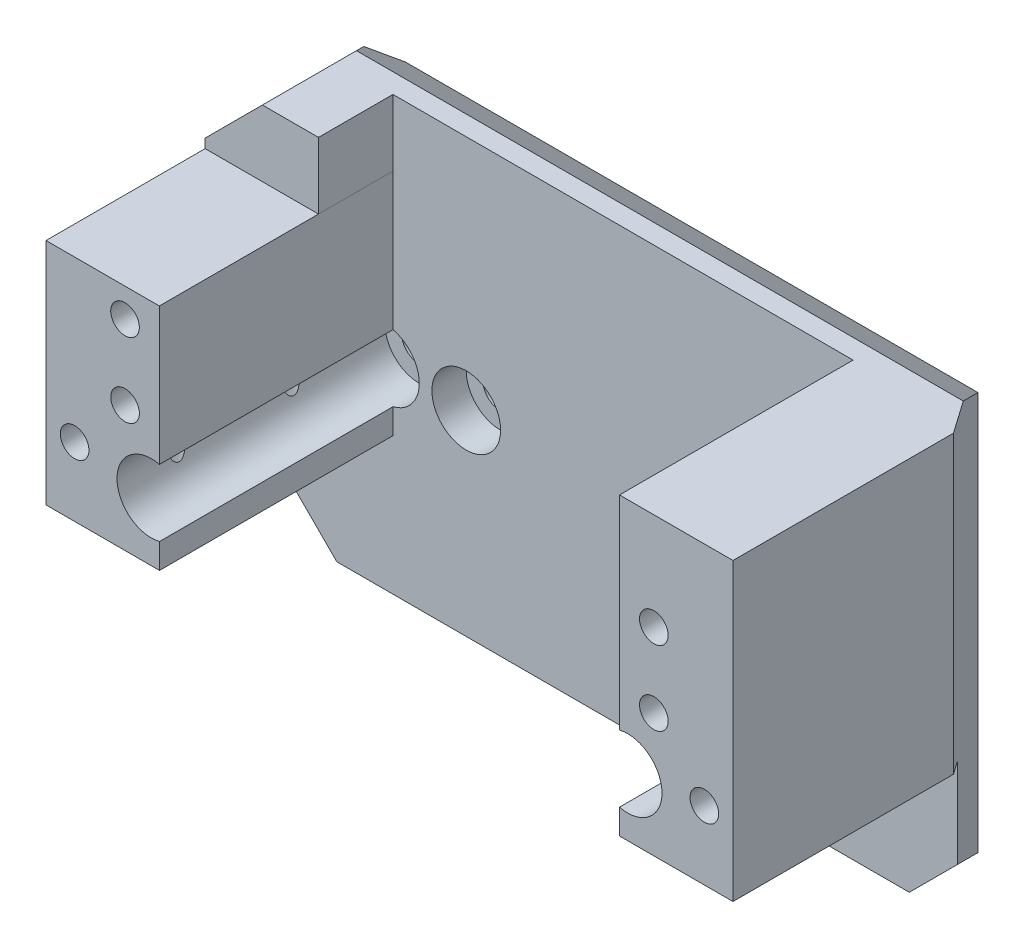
ISO-10303-21;
HEADER;
FILE_DESCRIPTION(('STEP AP214'),'2;1');
FILE_NAME('part.step','',(''),(''),'','','');
FILE_SCHEMA(('AUTOMOTIVE_DESIGN { 1 0 10303 214 1 1 1 1 }'));
ENDSEC;
DATA;
#1=APPLICATION_CONTEXT('core data for automotive mechanical design processes');
#2=APPLICATION_PROTOCOL_DEFINITION('international standard','automotive_design',2000,#1);
#3=PRODUCT_CONTEXT('',#1,'mechanical');
#4=PRODUCT('Part','Part','',(#3));
#5=PRODUCT_RELATED_PRODUCT_CATEGORY('part','',(#4));
#6=PRODUCT_DEFINITION_FORMATION('','',#4);
#7=PRODUCT_DEFINITION_CONTEXT('part definition',#1,'design');
#8=PRODUCT_DEFINITION('design','',#6,#7);
#9=PRODUCT_DEFINITION_SHAPE('','',#8);
#10=(LENGTH_UNIT() NAMED_UNIT(*) SI_UNIT(.MILLI.,.METRE.));
#11=(NAMED_UNIT(*) PLANE_ANGLE_UNIT() SI_UNIT($,.RADIAN.));
#12=(NAMED_UNIT(*) SI_UNIT($,.STERADIAN.) SOLID_ANGLE_UNIT());
#13=UNCERTAINTY_MEASURE_WITH_UNIT(LENGTH_MEASURE(1.E-05),#10,'distance_accuracy_value','');
#14=(GEOMETRIC_REPRESENTATION_CONTEXT(3) GLOBAL_UNCERTAINTY_ASSIGNED_CONTEXT((#13)) GLOBAL_UNIT_ASSIGNED_CONTEXT((#10,
#11,#12)) REPRESENTATION_CONTEXT('',''));
#15=CARTESIAN_POINT('',(0.,0.,0.));
#16=DIRECTION('',(0.,0.,1.));
#17=DIRECTION('',(1.,0.,0.));
#18=AXIS2_PLACEMENT_3D('',#15,#16,#17);
#19=CARTESIAN_POINT('',(23.0886859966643,9.3,19.9));
#20=DIRECTION('',(0.,0.,1.));
#21=DIRECTION('',(1.,0.,0.));
#22=AXIS2_PLACEMENT_3D('',#19,#20,#21);
#23=PLANE('',#22);
#24=CARTESIAN_POINT('',(23.0886859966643,9.3,19.9));
#25=DIRECTION('',(0.,0.,1.));
#26=DIRECTION('',(1.,0.,0.));
#27=AXIS2_PLACEMENT_3D('',#24,#25,#26);
#28=CIRCLE('',#27,1.25);
#29=CARTESIAN_POINT('',(24.3386859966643,9.3,19.9));
#30=VERTEX_POINT('',#29);
#31=EDGE_CURVE('E19',#30,#30,#28,.T.);
#32=ORIENTED_EDGE('',*,*,#31,.T.);
#33=EDGE_LOOP('',(#32));
#34=FACE_BOUND('',#33,.T.);
#35=ADVANCED_FACE('F16',(#34),#23,.T.);
#36=CARTESIAN_POINT('',(23.0886859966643,2.8,19.9));
#37=DIRECTION('',(0.,0.,1.));
#38=DIRECTION('',(1.,0.,0.));
#39=AXIS2_PLACEMENT_3D('',#36,#37,#38);
#40=PLANE('',#39);
#41=CARTESIAN_POINT('',(23.0886859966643,2.8,19.9));
#42=DIRECTION('',(0.,0.,1.));
#43=DIRECTION('',(1.,0.,0.));
#44=AXIS2_PLACEMENT_3D('',#41,#42,#43);
#45=CIRCLE('',#44,1.25);
#46=CARTESIAN_POINT('',(24.3386859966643,2.8,19.9));
#47=VERTEX_POINT('',#46);
#48=EDGE_CURVE('E697',#47,#47,#45,.T.);
#49=ORIENTED_EDGE('',*,*,#48,.T.);
#50=EDGE_LOOP('',(#49));
#51=FACE_BOUND('',#50,.T.);
#52=ADVANCED_FACE('F394',(#51),#40,.T.);
#53=CARTESIAN_POINT('',(27.5,-2.,19.9));
#54=DIRECTION('',(0.,0.,1.));
#55=DIRECTION('',(1.,0.,0.));
#56=AXIS2_PLACEMENT_3D('',#53,#54,#55);
#57=PLANE('',#56);
#58=CARTESIAN_POINT('',(27.5,-2.,19.9));
#59=DIRECTION('',(0.,0.,1.));
#60=DIRECTION('',(1.,0.,0.));
#61=AXIS2_PLACEMENT_3D('',#58,#59,#60);
#62=CIRCLE('',#61,1.25);
#63=CARTESIAN_POINT('',(28.75,-2.,19.9));
#64=VERTEX_POINT('',#63);
#65=EDGE_CURVE('E695',#64,#64,#62,.T.);
#66=ORIENTED_EDGE('',*,*,#65,.T.);
#67=EDGE_LOOP('',(#66));
#68=FACE_BOUND('',#67,.T.);
#69=ADVANCED_FACE('F391',(#68),#57,.T.);
#70=CARTESIAN_POINT('',(-23.0949091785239,3.,19.9));
#71=DIRECTION('',(0.,0.,1.));
#72=DIRECTION('',(1.,0.,0.));
#73=AXIS2_PLACEMENT_3D('',#70,#71,#72);
#74=PLANE('',#73);
#75=CARTESIAN_POINT('',(-23.0949091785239,3.,19.9));
#76=DIRECTION('',(0.,0.,1.));
#77=DIRECTION('',(1.,0.,0.));
#78=AXIS2_PLACEMENT_3D('',#75,#76,#77);
#79=CIRCLE('',#78,1.25);
#80=CARTESIAN_POINT('',(-21.8449091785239,3.,19.9));
#81=VERTEX_POINT('',#80);
#82=EDGE_CURVE('E692',#81,#81,#79,.T.);
#83=ORIENTED_EDGE('',*,*,#82,.T.);
#84=EDGE_LOOP('',(#83));
#85=FACE_BOUND('',#84,.T.);
#86=ADVANCED_FACE('F387',(#85),#74,.T.);
#87=CARTESIAN_POINT('',(-27.5,-2.,19.9));
#88=DIRECTION('',(0.,0.,1.));
#89=DIRECTION('',(1.,0.,0.));
#90=AXIS2_PLACEMENT_3D('',#87,#88,#89);
#91=PLANE('',#90);
#92=CARTESIAN_POINT('',(-27.5,-2.,19.9));
#93=DIRECTION('',(0.,0.,1.));
#94=DIRECTION('',(1.,0.,0.));
#95=AXIS2_PLACEMENT_3D('',#92,#93,#94);
#96=CIRCLE('',#95,1.25);
#97=CARTESIAN_POINT('',(-26.25,-2.,19.9));
#98=VERTEX_POINT('',#97);
#99=EDGE_CURVE('E689',#98,#98,#96,.T.);
#100=ORIENTED_EDGE('',*,*,#99,.T.);
#101=EDGE_LOOP('',(#100));
#102=FACE_BOUND('',#101,.T.);
#103=ADVANCED_FACE('F383',(#102),#91,.T.);
#104=CARTESIAN_POINT('',(-23.098586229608,9.5,19.9));
#105=DIRECTION('',(0.,0.,1.));
#106=DIRECTION('',(1.,0.,0.));
#107=AXIS2_PLACEMENT_3D('',#104,#105,#106);
#108=PLANE('',#107);
#109=CARTESIAN_POINT('',(-23.098586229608,9.5,19.9));
#110=DIRECTION('',(0.,0.,1.));
#111=DIRECTION('',(1.,0.,0.));
#112=AXIS2_PLACEMENT_3D('',#109,#110,#111);
#113=CIRCLE('',#112,1.25);
#114=CARTESIAN_POINT('',(-21.848586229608,9.5,19.9));
#115=VERTEX_POINT('',#114);
#116=EDGE_CURVE('E192',#115,#115,#113,.T.);
#117=ORIENTED_EDGE('',*,*,#116,.T.);
#118=EDGE_LOOP('',(#117));
#119=FACE_BOUND('',#118,.T.);
#120=ADVANCED_FACE('F380',(#119),#108,.T.);
#121=CARTESIAN_POINT('',(-24.8,-2.5,11.2));
#122=DIRECTION('',(0.,-1.,0.));
#123=DIRECTION('',(0.,0.,-1.));
#124=AXIS2_PLACEMENT_3D('',#121,#122,#123);
#125=PLANE('',#124);
#126=CARTESIAN_POINT('',(-24.8,-2.5,11.2));
#127=DIRECTION('',(0.,-1.,0.));
#128=DIRECTION('',(0.,0.,-1.));
#129=AXIS2_PLACEMENT_3D('',#126,#127,#128);
#130=CIRCLE('',#129,1.25);
#131=CARTESIAN_POINT('',(-23.7720117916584,-2.5,11.9111541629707));
#132=VERTEX_POINT('',#131);
#133=CARTESIAN_POINT('',(-23.7720117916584,-2.5,10.4888458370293));
#134=VERTEX_POINT('',#133);
#135=EDGE_CURVE('E183',#132,#134,#130,.T.);
#136=ORIENTED_EDGE('',*,*,#135,.T.);
#137=DIRECTION('',(0.,0.,-1.));
#138=VECTOR('',#137,1.);
#139=CARTESIAN_POINT('',(-23.7720117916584,-2.5,11.2));
#140=LINE('',#139,#138);
#141=EDGE_CURVE('E197',#134,#132,#140,.F.);
#142=ORIENTED_EDGE('',*,*,#141,.T.);
#143=EDGE_LOOP('',(#136,#142));
#144=FACE_BOUND('',#143,.T.);
#145=ADVANCED_FACE('F201',(#144),#125,.T.);
#146=CARTESIAN_POINT('',(-24.8,-2.5,21.2));
#147=DIRECTION('',(0.,-1.,0.));
#148=DIRECTION('',(0.,0.,-1.));
#149=AXIS2_PLACEMENT_3D('',#146,#147,#148);
#150=PLANE('',#149);
#151=CARTESIAN_POINT('',(-24.8,-2.5,21.2));
#152=DIRECTION('',(0.,-1.,0.));
#153=DIRECTION('',(0.,0.,-1.));
#154=AXIS2_PLACEMENT_3D('',#151,#152,#153);
#155=CIRCLE('',#154,1.25);
#156=CARTESIAN_POINT('',(-23.7720117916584,-2.5,21.9111541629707));
#157=VERTEX_POINT('',#156);
#158=CARTESIAN_POINT('',(-23.7720117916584,-2.5,20.4888458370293));
#159=VERTEX_POINT('',#158);
#160=EDGE_CURVE('E191',#157,#159,#155,.T.);
#161=ORIENTED_EDGE('',*,*,#160,.T.);
#162=DIRECTION('',(0.,0.,-1.));
#163=VECTOR('',#162,1.);
#164=CARTESIAN_POINT('',(-23.7720117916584,-2.5,21.2));
#165=LINE('',#164,#163);
#166=EDGE_CURVE('E202',#159,#157,#165,.F.);
#167=ORIENTED_EDGE('',*,*,#166,.T.);
#168=EDGE_LOOP('',(#161,#167));
#169=FACE_BOUND('',#168,.T.);
#170=ADVANCED_FACE('F373',(#169),#150,.T.);
#171=CARTESIAN_POINT('',(24.8,-2.5,21.2));
#172=DIRECTION('',(0.,-1.,0.));
#173=DIRECTION('',(0.,0.,-1.));
#174=AXIS2_PLACEMENT_3D('',#171,#172,#173);
#175=PLANE('',#174);
#176=CARTESIAN_POINT('',(24.8,-2.5,21.2));
#177=DIRECTION('',(0.,-1.,0.));
#178=DIRECTION('',(0.,0.,-1.));
#179=AXIS2_PLACEMENT_3D('',#176,#177,#178);
#180=CIRCLE('',#179,1.25);
#181=CARTESIAN_POINT('',(23.7720117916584,-2.5,20.4888458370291));
#182=VERTEX_POINT('',#181);
#183=CARTESIAN_POINT('',(23.7720117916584,-2.5,21.9111541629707));
#184=VERTEX_POINT('',#183);
#185=EDGE_CURVE('E676',#182,#184,#180,.T.);
#186=ORIENTED_EDGE('',*,*,#185,.T.);
#187=DIRECTION('',(0.,0.,-1.));
#188=VECTOR('',#187,1.);
#189=CARTESIAN_POINT('',(23.7720117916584,-2.5,21.2));
#190=LINE('',#189,#188);
#191=EDGE_CURVE('E205',#184,#182,#190,.T.);
#192=ORIENTED_EDGE('',*,*,#191,.T.);
#193=EDGE_LOOP('',(#186,#192));
#194=FACE_BOUND('',#193,.T.);
#195=ADVANCED_FACE('F369',(#194),#175,.T.);
#196=CARTESIAN_POINT('',(24.8,-2.5,11.2));
#197=DIRECTION('',(0.,-1.,0.));
#198=DIRECTION('',(0.,0.,-1.));
#199=AXIS2_PLACEMENT_3D('',#196,#197,#198);
#200=PLANE('',#199);
#201=CARTESIAN_POINT('',(24.8,-2.5,11.2));
#202=DIRECTION('',(0.,-1.,0.));
#203=DIRECTION('',(0.,0.,-1.));
#204=AXIS2_PLACEMENT_3D('',#201,#202,#203);
#205=CIRCLE('',#204,1.25);
#206=CARTESIAN_POINT('',(23.7720117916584,-2.5,10.4888458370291));
#207=VERTEX_POINT('',#206);
#208=CARTESIAN_POINT('',(23.7720117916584,-2.5,11.9111541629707));
#209=VERTEX_POINT('',#208);
#210=EDGE_CURVE('E680',#207,#209,#205,.T.);
#211=ORIENTED_EDGE('',*,*,#210,.T.);
#212=DIRECTION('',(0.,0.,-1.));
#213=VECTOR('',#212,1.);
#214=CARTESIAN_POINT('',(23.7720117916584,-2.5,11.2));
#215=LINE('',#214,#213);
#216=EDGE_CURVE('E672',#209,#207,#215,.T.);
#217=ORIENTED_EDGE('',*,*,#216,.T.);
#218=EDGE_LOOP('',(#211,#217));
#219=FACE_BOUND('',#218,.T.);
#220=ADVANCED_FACE('F365',(#219),#200,.T.);
#221=CARTESIAN_POINT('',(23.0886859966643,9.3,19.9));
#222=DIRECTION('',(0.,0.,1.));
#223=DIRECTION('',(1.,0.,0.));
#224=AXIS2_PLACEMENT_3D('',#221,#222,#223);
#225=CYLINDRICAL_SURFACE('',#224,1.25);
#226=CARTESIAN_POINT('',(23.0886859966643,9.3,26.4));
#227=DIRECTION('',(0.,0.,1.));
#228=DIRECTION('',(1.,0.,0.));
#229=AXIS2_PLACEMENT_3D('',#226,#227,#228);
#230=CIRCLE('',#229,1.25);
#231=CARTESIAN_POINT('',(24.3386859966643,9.3,26.4));
#232=VERTEX_POINT('',#231);
#233=EDGE_CURVE('E682',#232,#232,#230,.F.);
#234=ORIENTED_EDGE('',*,*,#233,.F.);
#235=EDGE_LOOP('',(#234));
#236=FACE_BOUND('',#235,.T.);
#237=ORIENTED_EDGE('',*,*,#31,.F.);
#238=EDGE_LOOP('',(#237));
#239=FACE_BOUND('',#238,.T.);
#240=ADVANCED_FACE('F361',(#236,#239),#225,.F.);
#241=CARTESIAN_POINT('',(23.0886859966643,2.8,19.9));
#242=DIRECTION('',(0.,0.,1.));
#243=DIRECTION('',(1.,0.,0.));
#244=AXIS2_PLACEMENT_3D('',#241,#242,#243);
#245=CYLINDRICAL_SURFACE('',#244,1.25);
#246=CARTESIAN_POINT('',(23.0886859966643,2.8,26.4));
#247=DIRECTION('',(0.,0.,1.));
#248=DIRECTION('',(1.,0.,0.));
#249=AXIS2_PLACEMENT_3D('',#246,#247,#248);
#250=CIRCLE('',#249,1.25);
#251=CARTESIAN_POINT('',(24.3386859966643,2.8,26.4));
#252=VERTEX_POINT('',#251);
#253=EDGE_CURVE('E713',#252,#252,#250,.F.);
#254=ORIENTED_EDGE('',*,*,#253,.F.);
#255=EDGE_LOOP('',(#254));
#256=FACE_BOUND('',#255,.T.);
#257=ORIENTED_EDGE('',*,*,#48,.F.);
#258=EDGE_LOOP('',(#257));
#259=FACE_BOUND('',#258,.T.);
#260=ADVANCED_FACE('F357',(#256,#259),#245,.F.);
#261=CARTESIAN_POINT('',(27.5,-2.,19.9));
#262=DIRECTION('',(0.,0.,1.));
#263=DIRECTION('',(1.,0.,0.));
#264=AXIS2_PLACEMENT_3D('',#261,#262,#263);
#265=CYLINDRICAL_SURFACE('',#264,1.25);
#266=CARTESIAN_POINT('',(27.5,-2.,26.4));
#267=DIRECTION('',(0.,0.,1.));
#268=DIRECTION('',(1.,0.,0.));
#269=AXIS2_PLACEMENT_3D('',#266,#267,#268);
#270=CIRCLE('',#269,1.25);
#271=CARTESIAN_POINT('',(28.75,-2.,26.4));
#272=VERTEX_POINT('',#271);
#273=EDGE_CURVE('E661',#272,#272,#270,.F.);
#274=ORIENTED_EDGE('',*,*,#273,.F.);
#275=EDGE_LOOP('',(#274));
#276=FACE_BOUND('',#275,.T.);
#277=ORIENTED_EDGE('',*,*,#65,.F.);
#278=EDGE_LOOP('',(#277));
#279=FACE_BOUND('',#278,.T.);
#280=ADVANCED_FACE('F353',(#276,#279),#265,.F.);
#281=CARTESIAN_POINT('',(-23.0949091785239,3.,19.9));
#282=DIRECTION('',(0.,0.,1.));
#283=DIRECTION('',(1.,0.,0.));
#284=AXIS2_PLACEMENT_3D('',#281,#282,#283);
#285=CYLINDRICAL_SURFACE('',#284,1.25);
#286=CARTESIAN_POINT('',(-23.0949091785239,3.,26.4));
#287=DIRECTION('',(0.,0.,1.));
#288=DIRECTION('',(1.,0.,0.));
#289=AXIS2_PLACEMENT_3D('',#286,#287,#288);
#290=CIRCLE('',#289,1.25);
#291=CARTESIAN_POINT('',(-21.8449091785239,3.,26.4));
#292=VERTEX_POINT('',#291);
#293=EDGE_CURVE('E651',#292,#292,#290,.F.);
#294=ORIENTED_EDGE('',*,*,#293,.F.);
#295=EDGE_LOOP('',(#294));
#296=FACE_BOUND('',#295,.T.);
#297=ORIENTED_EDGE('',*,*,#82,.F.);
#298=EDGE_LOOP('',(#297));
#299=FACE_BOUND('',#298,.T.);
#300=ADVANCED_FACE('F349',(#296,#299),#285,.F.);
#301=CARTESIAN_POINT('',(-27.5,-2.,19.9));
#302=DIRECTION('',(0.,0.,1.));
#303=DIRECTION('',(1.,0.,0.));
#304=AXIS2_PLACEMENT_3D('',#301,#302,#303);
#305=CYLINDRICAL_SURFACE('',#304,1.25);
#306=CARTESIAN_POINT('',(-27.5,-2.,26.4));
#307=DIRECTION('',(0.,0.,1.));
#308=DIRECTION('',(1.,0.,0.));
#309=AXIS2_PLACEMENT_3D('',#306,#307,#308);
#310=CIRCLE('',#309,1.25);
#311=CARTESIAN_POINT('',(-26.25,-2.,26.4));
#312=VERTEX_POINT('',#311);
#313=EDGE_CURVE('E720',#312,#312,#310,.F.);
#314=ORIENTED_EDGE('',*,*,#313,.F.);
#315=EDGE_LOOP('',(#314));
#316=FACE_BOUND('',#315,.T.);
#317=ORIENTED_EDGE('',*,*,#99,.F.);
#318=EDGE_LOOP('',(#317));
#319=FACE_BOUND('',#318,.T.);
#320=ADVANCED_FACE('F345',(#316,#319),#305,.F.);
#321=CARTESIAN_POINT('',(-23.098586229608,9.5,19.9));
#322=DIRECTION('',(0.,0.,1.));
#323=DIRECTION('',(1.,0.,0.));
#324=AXIS2_PLACEMENT_3D('',#321,#322,#323);
#325=CYLINDRICAL_SURFACE('',#324,1.25);
#326=CARTESIAN_POINT('',(-23.098586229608,9.5,26.4));
#327=DIRECTION('',(0.,0.,1.));
#328=DIRECTION('',(1.,0.,0.));
#329=AXIS2_PLACEMENT_3D('',#326,#327,#328);
#330=CIRCLE('',#329,1.25);
#331=CARTESIAN_POINT('',(-21.848586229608,9.5,26.4));
#332=VERTEX_POINT('',#331);
#333=EDGE_CURVE('E641',#332,#332,#330,.F.);
#334=ORIENTED_EDGE('',*,*,#333,.F.);
#335=EDGE_LOOP('',(#334));
#336=FACE_BOUND('',#335,.T.);
#337=ORIENTED_EDGE('',*,*,#116,.F.);
#338=EDGE_LOOP('',(#337));
#339=FACE_BOUND('',#338,.T.);
#340=ADVANCED_FACE('F341',(#336,#339),#325,.F.);
#341=CARTESIAN_POINT('',(-24.8,-2.5,11.2));
#342=DIRECTION('',(0.,-1.,0.));
#343=DIRECTION('',(0.,0.,-1.));
#344=AXIS2_PLACEMENT_3D('',#341,#342,#343);
#345=CYLINDRICAL_SURFACE('',#344,1.25);
#346=CARTESIAN_POINT('',(-23.7720117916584,-2.5,11.9111541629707));
#347=CARTESIAN_POINT('',(-23.7764018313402,-2.53262257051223,11.9174929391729));
#348=CARTESIAN_POINT('',(-23.7802726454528,-2.565468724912,11.9229710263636));
#349=CARTESIAN_POINT('',(-23.7869413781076,-2.63148761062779,11.9322888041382));
#350=CARTESIAN_POINT('',(-23.7897397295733,-2.66466020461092,11.9361291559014));
#351=CARTESIAN_POINT('',(-23.7965106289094,-2.76499285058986,11.9453674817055));
#352=CARTESIAN_POINT('',(-23.7987965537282,-2.83250822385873,11.9483962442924));
#353=CARTESIAN_POINT('',(-23.7987992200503,-2.95340770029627,11.9483934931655));
#354=CARTESIAN_POINT('',(-23.7973699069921,-3.00680062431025,11.9464947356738));
#355=CARTESIAN_POINT('',(-23.7916892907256,-3.11315212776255,11.9388056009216));
#356=CARTESIAN_POINT('',(-23.7874387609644,-3.1661108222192,11.9330162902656));
#357=CARTESIAN_POINT('',(-23.776234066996,-3.27101420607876,11.9172842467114));
#358=CARTESIAN_POINT('',(-23.7692854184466,-3.32296073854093,11.9073499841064));
#359=CARTESIAN_POINT('',(-23.7529011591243,-3.42531532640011,11.8828627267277));
#360=CARTESIAN_POINT('',(-23.7434680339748,-3.4757248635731,11.868314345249));
#361=CARTESIAN_POINT('',(-23.7220794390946,-3.57613373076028,11.8332666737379));
#362=CARTESIAN_POINT('',(-23.7100422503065,-3.62604587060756,11.8125636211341));
#363=CARTESIAN_POINT('',(-23.6843844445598,-3.72209976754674,11.7644862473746));
#364=CARTESIAN_POINT('',(-23.6707666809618,-3.76824807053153,11.7371238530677));
#365=CARTESIAN_POINT('',(-23.6464009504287,-3.84465361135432,11.6820638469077));
#366=CARTESIAN_POINT('',(-23.6357357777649,-3.87608819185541,11.6559753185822));
#367=CARTESIAN_POINT('',(-23.6149804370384,-3.93444228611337,11.5989315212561));
#368=CARTESIAN_POINT('',(-23.6048894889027,-3.9613680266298,11.5679830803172));
#369=CARTESIAN_POINT('',(-23.5884885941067,-4.00363919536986,11.5089478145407));
#370=CARTESIAN_POINT('',(-23.5818432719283,-4.0202233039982,11.4818458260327));
#371=CARTESIAN_POINT('',(-23.5700897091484,-4.04899278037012,11.4250741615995));
#372=CARTESIAN_POINT('',(-23.5649804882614,-4.06118095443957,11.3954061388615));
#373=CARTESIAN_POINT('',(-23.5568044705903,-4.08047173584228,11.3339116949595));
#374=CARTESIAN_POINT('',(-23.5537535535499,-4.08753483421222,11.3020705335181));
#375=CARTESIAN_POINT('',(-23.5501454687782,-4.09587196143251,11.23749992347));
#376=CARTESIAN_POINT('',(-23.549586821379,-4.09714942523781,11.2047710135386));
#377=CARTESIAN_POINT('',(-23.5509427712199,-4.09402673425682,11.1436308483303));
#378=CARTESIAN_POINT('',(-23.5525664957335,-4.09029438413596,11.1151760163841));
#379=CARTESIAN_POINT('',(-23.557622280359,-4.07852849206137,11.0593465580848));
#380=CARTESIAN_POINT('',(-23.5610543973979,-4.07049481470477,11.0319719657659));
#381=CARTESIAN_POINT('',(-23.5694689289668,-4.05043519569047,10.9785602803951));
#382=CARTESIAN_POINT('',(-23.5744720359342,-4.03835581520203,10.952546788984));
#383=CARTESIAN_POINT('',(-23.5856102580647,-4.01081006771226,10.9026582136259));
#384=CARTESIAN_POINT('',(-23.5917459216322,-3.99534205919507,10.8787841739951));
#385=CARTESIAN_POINT('',(-23.6080888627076,-3.95291370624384,10.821676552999));
#386=CARTESIAN_POINT('',(-23.6187693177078,-3.92413015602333,10.7899301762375));
#387=CARTESIAN_POINT('',(-23.6406239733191,-3.86183369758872,10.7316847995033));
#388=CARTESIAN_POINT('',(-23.6517992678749,-3.82830991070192,10.705198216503));
#389=CARTESIAN_POINT('',(-23.6788775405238,-3.74145497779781,10.6458355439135));
#390=CARTESIAN_POINT('',(-23.6945581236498,-3.68617090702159,10.615729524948));
#391=CARTESIAN_POINT('',(-23.7233816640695,-3.57108654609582,10.5641830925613));
#392=CARTESIAN_POINT('',(-23.7365188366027,-3.51127638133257,10.5427623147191));
#393=CARTESIAN_POINT('',(-23.756153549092,-3.40602944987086,10.5121692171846));
#394=CARTESIAN_POINT('',(-23.7634809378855,-3.36123813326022,10.5012469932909));
#395=CARTESIAN_POINT('',(-23.776161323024,-3.27067967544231,10.4827989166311));
#396=CARTESIAN_POINT('',(-23.7815134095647,-3.22491209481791,10.475274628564));
#397=CARTESIAN_POINT('',(-23.7944057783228,-3.08671008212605,10.4573550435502));
#398=CARTESIAN_POINT('',(-23.7987927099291,-2.99332087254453,10.451597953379));
#399=CARTESIAN_POINT('',(-23.798801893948,-2.83258982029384,10.4516105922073));
#400=CARTESIAN_POINT('',(-23.796519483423,-2.76521529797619,10.4546236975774));
#401=CARTESIAN_POINT('',(-23.7897620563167,-2.66494587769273,10.4638387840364));
#402=CARTESIAN_POINT('',(-23.7869618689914,-2.63171320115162,10.4676820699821));
#403=CARTESIAN_POINT('',(-23.7802858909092,-2.56557718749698,10.4770109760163));
#404=CARTESIAN_POINT('',(-23.7764097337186,-2.5326739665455,10.4824971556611));
#405=CARTESIAN_POINT('',(-23.7720117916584,-2.5,10.4888458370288));
#406=B_SPLINE_CURVE_WITH_KNOTS('',3,(#346,#347,#348,#349,#350,#351,#352,#353,#354,#355,#356,
#357,#358,#359,#360,#361,#362,#363,#364,#365,#366,#367,#368,#369,#370,#371,#372,#373,#374,#375,
#376,#377,#378,#379,#380,#381,#382,#383,#384,#385,#386,#387,#388,#389,#390,#391,#392,#393,#394,
#395,#396,#397,#398,#399,#400,#401,#402,#403,#404,#405),.UNSPECIFIED.,.F.,.F.,(4,2,2,2,2,2,2,2,
2,2,2,2,2,2,2,2,2,2,2,2,2,2,2,2,2,2,2,2,2,4),(0.,0.100524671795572,0.201008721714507,
0.403383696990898,0.563527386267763,0.723627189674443,0.883401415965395,1.04301639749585,
1.20865184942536,1.37399280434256,1.5002385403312,1.6263084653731,1.72331772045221,
1.82026493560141,1.91795179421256,2.01558064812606,2.10140520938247,2.18723247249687,
2.27424131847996,2.36129240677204,2.4930337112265,2.62508241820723,2.8186359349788,
3.01262462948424,3.15249103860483,3.29242178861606,3.5721099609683,3.77414225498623,
3.87480100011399,3.97549406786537),.UNSPECIFIED.);
#407=EDGE_CURVE('E189',#132,#134,#406,.T.);
#408=ORIENTED_EDGE('',*,*,#407,.T.);
#409=ORIENTED_EDGE('',*,*,#135,.F.);
#410=EDGE_LOOP('',(#408,#409));
#411=FACE_BOUND('',#410,.T.);
#412=CARTESIAN_POINT('',(-24.8,-8.,11.2));
#413=DIRECTION('',(0.,-1.,0.));
#414=DIRECTION('',(0.,0.,-1.));
#415=AXIS2_PLACEMENT_3D('',#412,#413,#414);
#416=CIRCLE('',#415,1.25);
#417=CARTESIAN_POINT('',(-24.8,-8.,9.94999999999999));
#418=VERTEX_POINT('',#417);
#419=EDGE_CURVE('E335',#418,#418,#416,.T.);
#420=ORIENTED_EDGE('',*,*,#419,.T.);
#421=EDGE_LOOP('',(#420));
#422=FACE_BOUND('',#421,.T.);
#423=ADVANCED_FACE('F187',(#411,#422),#345,.F.);
#424=CARTESIAN_POINT('',(-24.8,-2.5,21.2));
#425=DIRECTION('',(0.,-1.,0.));
#426=DIRECTION('',(0.,0.,-1.));
#427=AXIS2_PLACEMENT_3D('',#424,#425,#426);
#428=CYLINDRICAL_SURFACE('',#427,1.25);
#429=CARTESIAN_POINT('',(-23.7720117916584,-2.5,21.9111541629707));
#430=CARTESIAN_POINT('',(-23.7764018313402,-2.53262257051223,21.9174929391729));
#431=CARTESIAN_POINT('',(-23.7802726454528,-2.565468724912,21.9229710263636));
#432=CARTESIAN_POINT('',(-23.7869413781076,-2.63148761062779,21.9322888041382));
#433=CARTESIAN_POINT('',(-23.7897397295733,-2.66466020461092,21.9361291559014));
#434=CARTESIAN_POINT('',(-23.7965106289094,-2.76499285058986,21.9453674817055));
#435=CARTESIAN_POINT('',(-23.7987965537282,-2.83250822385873,21.9483962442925));
#436=CARTESIAN_POINT('',(-23.7987992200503,-2.95340770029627,21.9483934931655));
#437=CARTESIAN_POINT('',(-23.7973699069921,-3.00680062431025,21.9464947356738));
#438=CARTESIAN_POINT('',(-23.7916892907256,-3.11315212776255,21.9388056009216));
#439=CARTESIAN_POINT('',(-23.7874387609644,-3.1661108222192,21.9330162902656));
#440=CARTESIAN_POINT('',(-23.776234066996,-3.27101420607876,21.9172842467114));
#441=CARTESIAN_POINT('',(-23.7692854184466,-3.32296073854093,21.9073499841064));
#442=CARTESIAN_POINT('',(-23.7529011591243,-3.42531532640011,21.8828627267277));
#443=CARTESIAN_POINT('',(-23.7434680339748,-3.4757248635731,21.868314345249));
#444=CARTESIAN_POINT('',(-23.7220794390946,-3.57613373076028,21.8332666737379));
#445=CARTESIAN_POINT('',(-23.7100422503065,-3.62604587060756,21.8125636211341));
#446=CARTESIAN_POINT('',(-23.6843844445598,-3.72209976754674,21.7644862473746));
#447=CARTESIAN_POINT('',(-23.6707666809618,-3.76824807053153,21.7371238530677));
#448=CARTESIAN_POINT('',(-23.6464009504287,-3.84465361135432,21.6820638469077));
#449=CARTESIAN_POINT('',(-23.6357357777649,-3.87608819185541,21.6559753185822));
#450=CARTESIAN_POINT('',(-23.6149804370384,-3.93444228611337,21.5989315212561));
#451=CARTESIAN_POINT('',(-23.6048894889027,-3.9613680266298,21.5679830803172));
#452=CARTESIAN_POINT('',(-23.5884885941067,-4.00363919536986,21.5089478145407));
#453=CARTESIAN_POINT('',(-23.5818432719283,-4.0202233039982,21.4818458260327));
#454=CARTESIAN_POINT('',(-23.5700897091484,-4.04899278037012,21.4250741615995));
#455=CARTESIAN_POINT('',(-23.5649804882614,-4.06118095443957,21.3954061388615));
#456=CARTESIAN_POINT('',(-23.5568044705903,-4.08047173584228,21.3339116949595));
#457=CARTESIAN_POINT('',(-23.5537535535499,-4.08753483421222,21.3020705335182));
#458=CARTESIAN_POINT('',(-23.5501454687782,-4.09587196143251,21.23749992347));
#459=CARTESIAN_POINT('',(-23.549586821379,-4.09714942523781,21.2047710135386));
#460=CARTESIAN_POINT('',(-23.5509427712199,-4.09402673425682,21.1436308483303));
#461=CARTESIAN_POINT('',(-23.5525664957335,-4.09029438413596,21.1151760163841));
#462=CARTESIAN_POINT('',(-23.557622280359,-4.07852849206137,21.0593465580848));
#463=CARTESIAN_POINT('',(-23.5610543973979,-4.07049481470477,21.0319719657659));
#464=CARTESIAN_POINT('',(-23.5694689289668,-4.05043519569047,20.9785602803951));
#465=CARTESIAN_POINT('',(-23.5744720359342,-4.03835581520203,20.952546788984));
#466=CARTESIAN_POINT('',(-23.5856102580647,-4.01081006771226,20.9026582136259));
#467=CARTESIAN_POINT('',(-23.5917459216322,-3.99534205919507,20.8787841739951));
#468=CARTESIAN_POINT('',(-23.6080888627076,-3.95291370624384,20.821676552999));
#469=CARTESIAN_POINT('',(-23.6187693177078,-3.92413015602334,20.7899301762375));
#470=CARTESIAN_POINT('',(-23.6406239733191,-3.86183369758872,20.7316847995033));
#471=CARTESIAN_POINT('',(-23.6517992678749,-3.82830991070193,20.705198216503));
#472=CARTESIAN_POINT('',(-23.6788775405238,-3.74145497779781,20.6458355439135));
#473=CARTESIAN_POINT('',(-23.6945581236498,-3.6861709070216,20.615729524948));
#474=CARTESIAN_POINT('',(-23.7233816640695,-3.57108654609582,20.5641830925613));
#475=CARTESIAN_POINT('',(-23.7365188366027,-3.51127638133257,20.5427623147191));
#476=CARTESIAN_POINT('',(-23.756153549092,-3.40602944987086,20.5121692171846));
#477=CARTESIAN_POINT('',(-23.7634809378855,-3.36123813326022,20.5012469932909));
#478=CARTESIAN_POINT('',(-23.776161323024,-3.27067967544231,20.4827989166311));
#479=CARTESIAN_POINT('',(-23.7815134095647,-3.22491209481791,20.475274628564));
#480=CARTESIAN_POINT('',(-23.7944057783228,-3.08671008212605,20.4573550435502));
#481=CARTESIAN_POINT('',(-23.7987927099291,-2.99332087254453,20.451597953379));
#482=CARTESIAN_POINT('',(-23.798801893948,-2.83258982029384,20.4516105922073));
#483=CARTESIAN_POINT('',(-23.796519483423,-2.76521529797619,20.4546236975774));
#484=CARTESIAN_POINT('',(-23.7897620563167,-2.66494587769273,20.4638387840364));
#485=CARTESIAN_POINT('',(-23.7869618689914,-2.63171320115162,20.4676820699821));
#486=CARTESIAN_POINT('',(-23.7802858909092,-2.56557718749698,20.4770109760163));
#487=CARTESIAN_POINT('',(-23.7764097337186,-2.5326739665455,20.4824971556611));
#488=CARTESIAN_POINT('',(-23.7720117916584,-2.5,20.4888458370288));
#489=B_SPLINE_CURVE_WITH_KNOTS('',3,(#429,#430,#431,#432,#433,#434,#435,#436,#437,#438,#439,
#440,#441,#442,#443,#444,#445,#446,#447,#448,#449,#450,#451,#452,#453,#454,#455,#456,#457,#458,
#459,#460,#461,#462,#463,#464,#465,#466,#467,#468,#469,#470,#471,#472,#473,#474,#475,#476,#477,
#478,#479,#480,#481,#482,#483,#484,#485,#486,#487,#488),.UNSPECIFIED.,.F.,.F.,(4,2,2,2,2,2,2,2,
2,2,2,2,2,2,2,2,2,2,2,2,2,2,2,2,2,2,2,2,2,4),(0.,0.100524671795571,0.201008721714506,
0.403383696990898,0.563527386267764,0.723627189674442,0.883401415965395,1.04301639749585,
1.20865184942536,1.37399280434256,1.5002385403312,1.62630846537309,1.72331772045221,
1.82026493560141,1.91795179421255,2.01558064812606,2.10140520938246,2.18723247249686,
2.27424131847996,2.36129240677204,2.49303371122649,2.62508241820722,2.81863593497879,
3.01262462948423,3.15249103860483,3.29242178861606,3.5721099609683,3.77414225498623,
3.87480100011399,3.97549406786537),.UNSPECIFIED.);
#490=EDGE_CURVE('E199',#157,#159,#489,.T.);
#491=ORIENTED_EDGE('',*,*,#490,.T.);
#492=ORIENTED_EDGE('',*,*,#160,.F.);
#493=EDGE_LOOP('',(#491,#492));
#494=FACE_BOUND('',#493,.T.);
#495=CARTESIAN_POINT('',(-24.8,-8.,21.2));
#496=DIRECTION('',(0.,-1.,0.));
#497=DIRECTION('',(0.,0.,-1.));
#498=AXIS2_PLACEMENT_3D('',#495,#496,#497);
#499=CIRCLE('',#498,1.25);
#500=CARTESIAN_POINT('',(-24.8,-8.,19.95));
#501=VERTEX_POINT('',#500);
#502=EDGE_CURVE('E622',#501,#501,#499,.T.);
#503=ORIENTED_EDGE('',*,*,#502,.T.);
#504=EDGE_LOOP('',(#503));
#505=FACE_BOUND('',#504,.T.);
#506=ADVANCED_FACE('F340',(#494,#505),#428,.F.);
#507=CARTESIAN_POINT('',(24.8,-2.5,11.2));
#508=DIRECTION('',(0.,-1.,0.));
#509=DIRECTION('',(0.,0.,-1.));
#510=AXIS2_PLACEMENT_3D('',#507,#508,#509);
#511=CYLINDRICAL_SURFACE('',#510,1.25);
#512=CARTESIAN_POINT('',(24.8,-8.,11.2));
#513=DIRECTION('',(0.,-1.,0.));
#514=DIRECTION('',(0.,0.,-1.));
#515=AXIS2_PLACEMENT_3D('',#512,#513,#514);
#516=CIRCLE('',#515,1.25);
#517=CARTESIAN_POINT('',(24.8,-8.,9.94999999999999));
#518=VERTEX_POINT('',#517);
#519=EDGE_CURVE('E600',#518,#518,#516,.T.);
#520=ORIENTED_EDGE('',*,*,#519,.T.);
#521=EDGE_LOOP('',(#520));
#522=FACE_BOUND('',#521,.T.);
#523=CARTESIAN_POINT('',(23.7720117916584,-2.5,10.4888458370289));
#524=CARTESIAN_POINT('',(23.7764018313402,-2.53262257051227,10.4825070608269));
#525=CARTESIAN_POINT('',(23.7802726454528,-2.56546872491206,10.4770289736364));
#526=CARTESIAN_POINT('',(23.7869413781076,-2.63148761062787,10.4677111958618));
#527=CARTESIAN_POINT('',(23.7897397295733,-2.66466020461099,10.4638708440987));
#528=CARTESIAN_POINT('',(23.7965106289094,-2.76499285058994,10.4546325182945));
#529=CARTESIAN_POINT('',(23.7987965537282,-2.83250822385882,10.4516037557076));
#530=CARTESIAN_POINT('',(23.7987992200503,-2.95340770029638,10.4516065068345));
#531=CARTESIAN_POINT('',(23.7973699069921,-3.00680062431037,10.4535052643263));
#532=CARTESIAN_POINT('',(23.7916892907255,-3.11315212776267,10.4611943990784));
#533=CARTESIAN_POINT('',(23.7874387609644,-3.16611082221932,10.4669837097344));
#534=CARTESIAN_POINT('',(23.776234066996,-3.27101420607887,10.4827157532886));
#535=CARTESIAN_POINT('',(23.7692854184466,-3.32296073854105,10.4926500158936));
#536=CARTESIAN_POINT('',(23.7529011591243,-3.42531532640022,10.5171372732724));
#537=CARTESIAN_POINT('',(23.7434680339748,-3.47572486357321,10.5316856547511));
#538=CARTESIAN_POINT('',(23.7220794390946,-3.57613373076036,10.5667333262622));
#539=CARTESIAN_POINT('',(23.7100422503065,-3.62604587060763,10.587436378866));
#540=CARTESIAN_POINT('',(23.6843844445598,-3.72209976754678,10.6355137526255));
#541=CARTESIAN_POINT('',(23.6707666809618,-3.76824807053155,10.6628761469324));
#542=CARTESIAN_POINT('',(23.6464009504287,-3.84465361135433,10.7179361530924));
#543=CARTESIAN_POINT('',(23.6357357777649,-3.87608819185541,10.7440246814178));
#544=CARTESIAN_POINT('',(23.6149804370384,-3.93444228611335,10.801068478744));
#545=CARTESIAN_POINT('',(23.6048894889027,-3.96136802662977,10.8320169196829));
#546=CARTESIAN_POINT('',(23.5884885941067,-4.00363919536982,10.8910521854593));
#547=CARTESIAN_POINT('',(23.5818432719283,-4.02022330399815,10.9181541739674));
#548=CARTESIAN_POINT('',(23.5700897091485,-4.04899278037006,10.9749258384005));
#549=CARTESIAN_POINT('',(23.5649804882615,-4.06118095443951,11.0045938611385));
#550=CARTESIAN_POINT('',(23.5568044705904,-4.0804717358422,11.0660883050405));
#551=CARTESIAN_POINT('',(23.55375355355,-4.08753483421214,11.0979294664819));
#552=CARTESIAN_POINT('',(23.5501454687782,-4.09587196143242,11.16250007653));
#553=CARTESIAN_POINT('',(23.5495868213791,-4.09714942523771,11.1952289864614));
#554=CARTESIAN_POINT('',(23.55094277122,-4.09402673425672,11.2563691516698));
#555=CARTESIAN_POINT('',(23.5525664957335,-4.09029438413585,11.2848239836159));
#556=CARTESIAN_POINT('',(23.5576222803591,-4.07852849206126,11.3406534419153));
#557=CARTESIAN_POINT('',(23.5610543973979,-4.07049481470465,11.3680280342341));
#558=CARTESIAN_POINT('',(23.5694689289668,-4.05043519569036,11.4214397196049));
#559=CARTESIAN_POINT('',(23.5744720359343,-4.03835581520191,11.447453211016));
#560=CARTESIAN_POINT('',(23.5856102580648,-4.01081006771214,11.4973417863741));
#561=CARTESIAN_POINT('',(23.5917459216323,-3.99534205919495,11.5212158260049));
#562=CARTESIAN_POINT('',(23.6080888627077,-3.95291370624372,11.578323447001));
#563=CARTESIAN_POINT('',(23.6187693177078,-3.92413015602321,11.6100698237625));
#564=CARTESIAN_POINT('',(23.6406239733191,-3.86183369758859,11.6683152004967));
#565=CARTESIAN_POINT('',(23.6517992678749,-3.82830991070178,11.6948017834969));
#566=CARTESIAN_POINT('',(23.6788775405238,-3.74145497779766,11.7541644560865));
#567=CARTESIAN_POINT('',(23.6945581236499,-3.68617090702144,11.7842704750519));
#568=CARTESIAN_POINT('',(23.7233816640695,-3.57108654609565,11.8358169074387));
#569=CARTESIAN_POINT('',(23.7365188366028,-3.5112763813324,11.8572376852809));
#570=CARTESIAN_POINT('',(23.756153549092,-3.40602944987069,11.8878307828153));
#571=CARTESIAN_POINT('',(23.7634809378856,-3.36123813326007,11.8987530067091));
#572=CARTESIAN_POINT('',(23.776161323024,-3.27067967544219,11.9172010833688));
#573=CARTESIAN_POINT('',(23.7815134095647,-3.2249120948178,11.9247253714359));
#574=CARTESIAN_POINT('',(23.7944057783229,-3.08671008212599,11.9426449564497));
#575=CARTESIAN_POINT('',(23.7987927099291,-2.9933208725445,11.948402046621));
#576=CARTESIAN_POINT('',(23.798801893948,-2.83258982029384,11.9483894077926));
#577=CARTESIAN_POINT('',(23.796519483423,-2.76521529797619,11.9453763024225));
#578=CARTESIAN_POINT('',(23.7897620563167,-2.66494587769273,11.9361612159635));
#579=CARTESIAN_POINT('',(23.7869618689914,-2.63171320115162,11.9323179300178));
#580=CARTESIAN_POINT('',(23.7802858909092,-2.56557718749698,11.9229890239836));
#581=CARTESIAN_POINT('',(23.7764097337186,-2.5326739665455,11.9175028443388));
#582=CARTESIAN_POINT('',(23.7720117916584,-2.5,11.9111541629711));
#583=B_SPLINE_CURVE_WITH_KNOTS('',3,(#523,#524,#525,#526,#527,#528,#529,#530,#531,#532,#533,
#534,#535,#536,#537,#538,#539,#540,#541,#542,#543,#544,#545,#546,#547,#548,#549,#550,#551,#552,
#553,#554,#555,#556,#557,#558,#559,#560,#561,#562,#563,#564,#565,#566,#567,#568,#569,#570,#571,
#572,#573,#574,#575,#576,#577,#578,#579,#580,#581,#582),.UNSPECIFIED.,.F.,.F.,(4,2,2,2,2,2,2,2,
2,2,2,2,2,2,2,2,2,2,2,2,2,2,2,2,2,2,2,2,2,4),(0.,0.100524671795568,0.201008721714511,
0.403383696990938,0.563527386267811,0.723627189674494,0.883401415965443,1.0430163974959,
1.20865184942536,1.37399280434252,1.50023854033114,1.62630846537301,1.72331772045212,
1.8202649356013,1.91795179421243,2.01558064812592,2.10140520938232,2.18723247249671,
2.2742413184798,2.36129240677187,2.49303371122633,2.62508241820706,2.81863593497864,
3.01262462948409,3.15249103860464,3.29242178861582,3.57210996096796,3.77414225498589,
3.87480100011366,3.97549406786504),.UNSPECIFIED.);
#584=EDGE_CURVE('E280',#207,#209,#583,.T.);
#585=ORIENTED_EDGE('',*,*,#584,.T.);
#586=ORIENTED_EDGE('',*,*,#210,.F.);
#587=EDGE_LOOP('',(#585,#586));
#588=FACE_BOUND('',#587,.T.);
#589=ADVANCED_FACE('F733',(#522,#588),#511,.F.);
#590=CARTESIAN_POINT('',(24.8,-2.5,21.2));
#591=DIRECTION('',(0.,-1.,0.));
#592=DIRECTION('',(0.,0.,-1.));
#593=AXIS2_PLACEMENT_3D('',#590,#591,#592);
#594=CYLINDRICAL_SURFACE('',#593,1.25);
#595=CARTESIAN_POINT('',(24.8,-8.,21.2));
#596=DIRECTION('',(0.,-1.,0.));
#597=DIRECTION('',(0.,0.,-1.));
#598=AXIS2_PLACEMENT_3D('',#595,#596,#597);
#599=CIRCLE('',#598,1.25);
#600=CARTESIAN_POINT('',(24.8,-8.,19.95));
#601=VERTEX_POINT('',#600);
#602=EDGE_CURVE('E530',#601,#601,#599,.T.);
#603=ORIENTED_EDGE('',*,*,#602,.T.);
#604=EDGE_LOOP('',(#603));
#605=FACE_BOUND('',#604,.T.);
#606=CARTESIAN_POINT('',(23.7720117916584,-2.5,20.4888458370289));
#607=CARTESIAN_POINT('',(23.7764018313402,-2.53262257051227,20.4825070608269));
#608=CARTESIAN_POINT('',(23.7802726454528,-2.56546872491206,20.4770289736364));
#609=CARTESIAN_POINT('',(23.7869413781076,-2.63148761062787,20.4677111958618));
#610=CARTESIAN_POINT('',(23.7897397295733,-2.66466020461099,20.4638708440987));
#611=CARTESIAN_POINT('',(23.7965106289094,-2.76499285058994,20.4546325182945));
#612=CARTESIAN_POINT('',(23.7987965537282,-2.83250822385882,20.4516037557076));
#613=CARTESIAN_POINT('',(23.7987992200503,-2.95340770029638,20.4516065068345));
#614=CARTESIAN_POINT('',(23.7973699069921,-3.00680062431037,20.4535052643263));
#615=CARTESIAN_POINT('',(23.7916892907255,-3.11315212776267,20.4611943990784));
#616=CARTESIAN_POINT('',(23.7874387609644,-3.16611082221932,20.4669837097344));
#617=CARTESIAN_POINT('',(23.776234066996,-3.27101420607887,20.4827157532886));
#618=CARTESIAN_POINT('',(23.7692854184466,-3.32296073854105,20.4926500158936));
#619=CARTESIAN_POINT('',(23.7529011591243,-3.42531532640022,20.5171372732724));
#620=CARTESIAN_POINT('',(23.7434680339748,-3.47572486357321,20.5316856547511));
#621=CARTESIAN_POINT('',(23.7220794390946,-3.57613373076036,20.5667333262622));
#622=CARTESIAN_POINT('',(23.7100422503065,-3.62604587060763,20.587436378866));
#623=CARTESIAN_POINT('',(23.6843844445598,-3.72209976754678,20.6355137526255));
#624=CARTESIAN_POINT('',(23.6707666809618,-3.76824807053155,20.6628761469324));
#625=CARTESIAN_POINT('',(23.6464009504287,-3.84465361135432,20.7179361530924));
#626=CARTESIAN_POINT('',(23.6357357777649,-3.87608819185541,20.7440246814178));
#627=CARTESIAN_POINT('',(23.6149804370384,-3.93444228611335,20.801068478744));
#628=CARTESIAN_POINT('',(23.6048894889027,-3.96136802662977,20.8320169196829));
#629=CARTESIAN_POINT('',(23.5884885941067,-4.00363919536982,20.8910521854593));
#630=CARTESIAN_POINT('',(23.5818432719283,-4.02022330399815,20.9181541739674));
#631=CARTESIAN_POINT('',(23.5700897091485,-4.04899278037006,20.9749258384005));
#632=CARTESIAN_POINT('',(23.5649804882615,-4.06118095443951,21.0045938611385));
#633=CARTESIAN_POINT('',(23.5568044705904,-4.0804717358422,21.0660883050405));
#634=CARTESIAN_POINT('',(23.55375355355,-4.08753483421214,21.0979294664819));
#635=CARTESIAN_POINT('',(23.5501454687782,-4.09587196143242,21.16250007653));
#636=CARTESIAN_POINT('',(23.5495868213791,-4.09714942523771,21.1952289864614));
#637=CARTESIAN_POINT('',(23.55094277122,-4.09402673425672,21.2563691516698));
#638=CARTESIAN_POINT('',(23.5525664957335,-4.09029438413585,21.2848239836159));
#639=CARTESIAN_POINT('',(23.5576222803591,-4.07852849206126,21.3406534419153));
#640=CARTESIAN_POINT('',(23.5610543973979,-4.07049481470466,21.3680280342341));
#641=CARTESIAN_POINT('',(23.5694689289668,-4.05043519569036,21.4214397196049));
#642=CARTESIAN_POINT('',(23.5744720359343,-4.03835581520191,21.447453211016));
#643=CARTESIAN_POINT('',(23.5856102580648,-4.01081006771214,21.4973417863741));
#644=CARTESIAN_POINT('',(23.5917459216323,-3.99534205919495,21.5212158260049));
#645=CARTESIAN_POINT('',(23.6080888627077,-3.95291370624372,21.578323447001));
#646=CARTESIAN_POINT('',(23.6187693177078,-3.92413015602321,21.6100698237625));
#647=CARTESIAN_POINT('',(23.6406239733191,-3.86183369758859,21.6683152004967));
#648=CARTESIAN_POINT('',(23.6517992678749,-3.82830991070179,21.6948017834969));
#649=CARTESIAN_POINT('',(23.6788775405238,-3.74145497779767,21.7541644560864));
#650=CARTESIAN_POINT('',(23.6945581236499,-3.68617090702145,21.7842704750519));
#651=CARTESIAN_POINT('',(23.7233816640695,-3.57108654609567,21.8358169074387));
#652=CARTESIAN_POINT('',(23.7365188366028,-3.51127638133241,21.8572376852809));
#653=CARTESIAN_POINT('',(23.756153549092,-3.40602944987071,21.8878307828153));
#654=CARTESIAN_POINT('',(23.7634809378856,-3.36123813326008,21.8987530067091));
#655=CARTESIAN_POINT('',(23.776161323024,-3.2706796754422,21.9172010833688));
#656=CARTESIAN_POINT('',(23.7815134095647,-3.22491209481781,21.9247253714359));
#657=CARTESIAN_POINT('',(23.7944057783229,-3.086710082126,21.9426449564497));
#658=CARTESIAN_POINT('',(23.7987927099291,-2.9933208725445,21.948402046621));
#659=CARTESIAN_POINT('',(23.798801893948,-2.83258982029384,21.9483894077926));
#660=CARTESIAN_POINT('',(23.796519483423,-2.76521529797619,21.9453763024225));
#661=CARTESIAN_POINT('',(23.7897620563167,-2.66494587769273,21.9361612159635));
#662=CARTESIAN_POINT('',(23.7869618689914,-2.63171320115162,21.9323179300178));
#663=CARTESIAN_POINT('',(23.7802858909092,-2.56557718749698,21.9229890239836));
#664=CARTESIAN_POINT('',(23.7764097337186,-2.5326739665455,21.9175028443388));
#665=CARTESIAN_POINT('',(23.7720117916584,-2.5,21.9111541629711));
#666=B_SPLINE_CURVE_WITH_KNOTS('',3,(#606,#607,#608,#609,#610,#611,#612,#613,#614,#615,#616,
#617,#618,#619,#620,#621,#622,#623,#624,#625,#626,#627,#628,#629,#630,#631,#632,#633,#634,#635,
#636,#637,#638,#639,#640,#641,#642,#643,#644,#645,#646,#647,#648,#649,#650,#651,#652,#653,#654,
#655,#656,#657,#658,#659,#660,#661,#662,#663,#664,#665),.UNSPECIFIED.,.F.,.F.,(4,2,2,2,2,2,2,2,
2,2,2,2,2,2,2,2,2,2,2,2,2,2,2,2,2,2,2,2,2,4),(0.,0.100524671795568,0.201008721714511,
0.403383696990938,0.563527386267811,0.723627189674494,0.883401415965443,1.0430163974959,
1.20865184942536,1.37399280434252,1.50023854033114,1.62630846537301,1.72331772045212,
1.8202649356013,1.91795179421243,2.01558064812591,2.10140520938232,2.1872324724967,
2.27424131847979,2.36129240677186,2.49303371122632,2.62508241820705,2.81863593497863,
3.01262462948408,3.15249103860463,3.29242178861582,3.57210996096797,3.77414225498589,
3.87480100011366,3.97549406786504),.UNSPECIFIED.);
#667=EDGE_CURVE('E271',#182,#184,#666,.T.);
#668=ORIENTED_EDGE('',*,*,#667,.T.);
#669=ORIENTED_EDGE('',*,*,#185,.F.);
#670=EDGE_LOOP('',(#668,#669));
#671=FACE_BOUND('',#670,.T.);
#672=ADVANCED_FACE('F287',(#605,#671),#594,.F.);
#673=CARTESIAN_POINT('',(-20.1,65.0799290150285,26.4));
#674=DIRECTION('',(0.,0.,1.));
#675=DIRECTION('',(1.,0.,0.));
#676=AXIS2_PLACEMENT_3D('',#673,#674,#675);
#677=PLANE('',#676);
#678=DIRECTION('',(1.,0.,0.));
#679=VECTOR('',#678,1.);
#680=CARTESIAN_POINT('',(20.0886859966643,-8.,26.4));
#681=LINE('',#680,#679);
#682=CARTESIAN_POINT('',(20.0886859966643,-8.,26.4));
#683=VERTEX_POINT('',#682);
#684=CARTESIAN_POINT('',(30.,-8.,26.4));
#685=VERTEX_POINT('',#684);
#686=EDGE_CURVE('E520',#683,#685,#681,.T.);
#687=ORIENTED_EDGE('',*,*,#686,.T.);
#688=DIRECTION('',(0.,1.,0.));
#689=VECTOR('',#688,1.);
#690=CARTESIAN_POINT('',(30.,20.,26.4));
#691=LINE('',#690,#689);
#692=CARTESIAN_POINT('',(30.,17.8,26.4));
#693=VERTEX_POINT('',#692);
#694=EDGE_CURVE('E256',#685,#693,#691,.T.);
#695=ORIENTED_EDGE('',*,*,#694,.T.);
#696=DIRECTION('',(1.,0.,0.));
#697=VECTOR('',#696,1.);
#698=CARTESIAN_POINT('',(30.,17.8,26.4));
#699=LINE('',#698,#697);
#700=CARTESIAN_POINT('',(20.0886859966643,17.8,26.4));
#701=VERTEX_POINT('',#700);
#702=EDGE_CURVE('E563',#693,#701,#699,.F.);
#703=ORIENTED_EDGE('',*,*,#702,.T.);
#704=DIRECTION('',(0.,1.,0.));
#705=VECTOR('',#704,1.);
#706=CARTESIAN_POINT('',(20.0886859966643,0.014745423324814,26.4));
#707=LINE('',#706,#705);
#708=CARTESIAN_POINT('',(20.0886859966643,0.0147454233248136,26.4));
#709=VERTEX_POINT('',#708);
#710=EDGE_CURVE('E266',#701,#709,#707,.F.);
#711=ORIENTED_EDGE('',*,*,#710,.T.);
#712=CARTESIAN_POINT('',(20.7987980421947,-2.89999999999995,26.4));
#713=DIRECTION('',(0.,0.,1.));
#714=DIRECTION('',(1.,0.,0.));
#715=AXIS2_PLACEMENT_3D('',#712,#713,#714);
#716=CIRCLE('',#715,3.);
#717=CARTESIAN_POINT('',(20.0886859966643,-5.81474542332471,26.4));
#718=VERTEX_POINT('',#717);
#719=EDGE_CURVE('E267',#709,#718,#716,.F.);
#720=ORIENTED_EDGE('',*,*,#719,.T.);
#721=DIRECTION('',(0.,1.,0.));
#722=VECTOR('',#721,1.);
#723=CARTESIAN_POINT('',(20.0886859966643,-8.,26.4));
#724=LINE('',#723,#722);
#725=EDGE_CURVE('E510',#718,#683,#724,.F.);
#726=ORIENTED_EDGE('',*,*,#725,.T.);
#727=EDGE_LOOP('',(#687,#695,#703,#711,#720,#726));
#728=FACE_BOUND('',#727,.T.);
#729=ORIENTED_EDGE('',*,*,#273,.T.);
#730=EDGE_LOOP('',(#729));
#731=FACE_BOUND('',#730,.T.);
#732=ORIENTED_EDGE('',*,*,#253,.T.);
#733=EDGE_LOOP('',(#732));
#734=FACE_BOUND('',#733,.T.);
#735=ORIENTED_EDGE('',*,*,#233,.T.);
#736=EDGE_LOOP('',(#735));
#737=FACE_BOUND('',#736,.T.);
#738=ADVANCED_FACE('F749',(#728,#731,#734,#737),#677,.T.);
#739=CARTESIAN_POINT('',(0.,0.,12.5));
#740=DIRECTION('',(0.,0.,1.));
#741=DIRECTION('',(1.,0.,0.));
#742=AXIS2_PLACEMENT_3D('',#739,#740,#741);
#743=PLANE('',#742);
#744=DIRECTION('',(1.,0.,0.));
#745=VECTOR('',#744,1.);
#746=CARTESIAN_POINT('',(30.,17.8,12.5));
#747=LINE('',#746,#745);
#748=CARTESIAN_POINT('',(-20.1,17.8,12.5));
#749=VERTEX_POINT('',#748);
#750=CARTESIAN_POINT('',(-25.,17.8,12.5));
#751=VERTEX_POINT('',#750);
#752=EDGE_CURVE('E568',#749,#751,#747,.F.);
#753=ORIENTED_EDGE('',*,*,#752,.T.);
#754=DIRECTION('',(0.707106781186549,0.707106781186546,0.));
#755=VECTOR('',#754,1.);
#756=CARTESIAN_POINT('',(-30.,12.8,12.5));
#757=LINE('',#756,#755);
#758=CARTESIAN_POINT('',(-30.,12.8,12.5));
#759=VERTEX_POINT('',#758);
#760=EDGE_CURVE('E657',#751,#759,#757,.F.);
#761=ORIENTED_EDGE('',*,*,#760,.T.);
#762=DIRECTION('',(0.,1.,0.));
#763=VECTOR('',#762,1.);
#764=CARTESIAN_POINT('',(-30.,0.,12.5));
#765=LINE('',#764,#763);
#766=CARTESIAN_POINT('',(-30.,12.,12.5));
#767=VERTEX_POINT('',#766);
#768=EDGE_CURVE('E652',#759,#767,#765,.F.);
#769=ORIENTED_EDGE('',*,*,#768,.T.);
#770=DIRECTION('',(1.,0.,0.));
#771=VECTOR('',#770,1.);
#772=CARTESIAN_POINT('',(-20.1,12.,12.5));
#773=LINE('',#772,#771);
#774=CARTESIAN_POINT('',(-20.1,12.,12.5));
#775=VERTEX_POINT('',#774);
#776=EDGE_CURVE('E648',#767,#775,#773,.T.);
#777=ORIENTED_EDGE('',*,*,#776,.T.);
#778=DIRECTION('',(0.,-1.,0.));
#779=VECTOR('',#778,1.);
#780=CARTESIAN_POINT('',(-20.1,12.,12.5));
#781=LINE('',#780,#779);
#782=EDGE_CURVE('E571',#775,#749,#781,.F.);
#783=ORIENTED_EDGE('',*,*,#782,.T.);
#784=EDGE_LOOP('',(#753,#761,#769,#777,#783));
#785=FACE_BOUND('',#784,.T.);
#786=ADVANCED_FACE('F754',(#785),#743,.T.);
#787=CARTESIAN_POINT('',(-20.1,12.,56.1024265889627));
#788=DIRECTION('',(0.,-1.,0.));
#789=DIRECTION('',(0.,0.,-1.));
#790=AXIS2_PLACEMENT_3D('',#787,#788,#789);
#791=PLANE('',#790);
#792=ORIENTED_EDGE('',*,*,#776,.F.);
#793=DIRECTION('',(0.,0.,1.));
#794=VECTOR('',#793,1.);
#795=CARTESIAN_POINT('',(-30.,12.,6.));
#796=LINE('',#795,#794);
#797=CARTESIAN_POINT('',(-30.,12.,26.4));
#798=VERTEX_POINT('',#797);
#799=EDGE_CURVE('E633',#767,#798,#796,.T.);
#800=ORIENTED_EDGE('',*,*,#799,.T.);
#801=DIRECTION('',(1.,0.,0.));
#802=VECTOR('',#801,1.);
#803=CARTESIAN_POINT('',(-20.1,12.,26.4));
#804=LINE('',#803,#802);
#805=CARTESIAN_POINT('',(-20.1,12.,26.4));
#806=VERTEX_POINT('',#805);
#807=EDGE_CURVE('E573',#806,#798,#804,.F.);
#808=ORIENTED_EDGE('',*,*,#807,.F.);
#809=DIRECTION('',(0.,0.,1.));
#810=VECTOR('',#809,1.);
#811=CARTESIAN_POINT('',(-20.1,12.,56.1024265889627));
#812=LINE('',#811,#810);
#813=EDGE_CURVE('E553',#806,#775,#812,.F.);
#814=ORIENTED_EDGE('',*,*,#813,.T.);
#815=EDGE_LOOP('',(#792,#800,#808,#814));
#816=FACE_BOUND('',#815,.T.);
#817=ADVANCED_FACE('F894',(#816),#791,.F.);
#818=CARTESIAN_POINT('',(-20.1,65.0799290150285,26.4));
#819=DIRECTION('',(0.,0.,1.));
#820=DIRECTION('',(1.,0.,0.));
#821=AXIS2_PLACEMENT_3D('',#818,#819,#820);
#822=PLANE('',#821);
#823=ORIENTED_EDGE('',*,*,#807,.T.);
#824=DIRECTION('',(0.,1.,0.));
#825=VECTOR('',#824,1.);
#826=CARTESIAN_POINT('',(-30.,20.,26.4));
#827=LINE('',#826,#825);
#828=CARTESIAN_POINT('',(-30.,-8.,26.4));
#829=VERTEX_POINT('',#828);
#830=EDGE_CURVE('E628',#798,#829,#827,.F.);
#831=ORIENTED_EDGE('',*,*,#830,.T.);
#832=DIRECTION('',(1.,0.,0.));
#833=VECTOR('',#832,1.);
#834=CARTESIAN_POINT('',(-20.0886859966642,-8.,26.4));
#835=LINE('',#834,#833);
#836=CARTESIAN_POINT('',(-20.0886859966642,-8.,26.4));
#837=VERTEX_POINT('',#836);
#838=EDGE_CURVE('E537',#829,#837,#835,.T.);
#839=ORIENTED_EDGE('',*,*,#838,.T.);
#840=DIRECTION('',(0.000565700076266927,-0.999999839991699,0.));
#841=VECTOR('',#840,1.);
#842=CARTESIAN_POINT('',(-20.0886859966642,-8.,26.4));
#843=LINE('',#842,#841);
#844=CARTESIAN_POINT('',(-20.0899220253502,-5.81504627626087,26.4));
#845=VERTEX_POINT('',#844);
#846=EDGE_CURVE('E534',#837,#845,#843,.F.);
#847=ORIENTED_EDGE('',*,*,#846,.T.);
#848=CARTESIAN_POINT('',(-20.7987980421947,-2.89999999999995,26.4));
#849=DIRECTION('',(0.,0.,1.));
#850=DIRECTION('',(1.,0.,0.));
#851=AXIS2_PLACEMENT_3D('',#848,#849,#850);
#852=CIRCLE('',#851,3.);
#853=CARTESIAN_POINT('',(-20.0932205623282,0.0158464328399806,26.4));
#854=VERTEX_POINT('',#853);
#855=EDGE_CURVE('E548',#845,#854,#852,.F.);
#856=ORIENTED_EDGE('',*,*,#855,.T.);
#857=DIRECTION('',(0.000565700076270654,-0.999999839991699,0.));
#858=VECTOR('',#857,1.);
#859=CARTESIAN_POINT('',(-20.0932205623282,0.0158464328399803,26.4));
#860=LINE('',#859,#858);
#861=EDGE_CURVE('E549',#854,#806,#860,.F.);
#862=ORIENTED_EDGE('',*,*,#861,.T.);
#863=EDGE_LOOP('',(#823,#831,#839,#847,#856,#862));
#864=FACE_BOUND('',#863,.T.);
#865=ORIENTED_EDGE('',*,*,#333,.T.);
#866=EDGE_LOOP('',(#865));
#867=FACE_BOUND('',#866,.T.);
#868=ORIENTED_EDGE('',*,*,#313,.T.);
#869=EDGE_LOOP('',(#868));
#870=FACE_BOUND('',#869,.T.);
#871=ORIENTED_EDGE('',*,*,#293,.T.);
#872=EDGE_LOOP('',(#871));
#873=FACE_BOUND('',#872,.T.);
#874=ADVANCED_FACE('F903',(#864,#867,#870,#873),#822,.T.);
#875=CARTESIAN_POINT('',(-13.6963498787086,-2.89999999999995,-8.48528137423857));
#876=DIRECTION('',(0.,0.,1.));
#877=DIRECTION('',(1.,0.,0.));
#878=AXIS2_PLACEMENT_3D('',#875,#876,#877);
#879=CYLINDRICAL_SURFACE('',#878,3.);
#880=CARTESIAN_POINT('',(-13.6963498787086,-2.89999999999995,6.));
#881=DIRECTION('',(0.,0.,1.));
#882=DIRECTION('',(1.,0.,0.));
#883=AXIS2_PLACEMENT_3D('',#880,#881,#882);
#884=CIRCLE('',#883,3.);
#885=CARTESIAN_POINT('',(-10.6963498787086,-2.89999999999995,6.));
#886=VERTEX_POINT('',#885);
#887=EDGE_CURVE('E249',#886,#886,#884,.F.);
#888=ORIENTED_EDGE('',*,*,#887,.F.);
#889=EDGE_LOOP('',(#888));
#890=FACE_BOUND('',#889,.T.);
#891=CARTESIAN_POINT('',(-13.6963498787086,-2.89999999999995,3.));
#892=DIRECTION('',(0.,0.,1.));
#893=DIRECTION('',(1.,0.,0.));
#894=AXIS2_PLACEMENT_3D('',#891,#892,#893);
#895=CIRCLE('',#894,3.);
#896=CARTESIAN_POINT('',(-10.6963498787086,-2.89999999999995,3.));
#897=VERTEX_POINT('',#896);
#898=EDGE_CURVE('E253',#897,#897,#895,.T.);
#899=ORIENTED_EDGE('',*,*,#898,.F.);
#900=EDGE_LOOP('',(#899));
#901=FACE_BOUND('',#900,.T.);
#902=ADVANCED_FACE('F912',(#890,#901),#879,.F.);
#903=CARTESIAN_POINT('',(13.6963498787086,-2.89999999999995,-8.48528137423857));
#904=DIRECTION('',(0.,0.,1.));
#905=DIRECTION('',(1.,0.,0.));
#906=AXIS2_PLACEMENT_3D('',#903,#904,#905);
#907=CYLINDRICAL_SURFACE('',#906,3.);
#908=CARTESIAN_POINT('',(13.6963498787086,-2.89999999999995,6.));
#909=DIRECTION('',(0.,0.,1.));
#910=DIRECTION('',(1.,0.,0.));
#911=AXIS2_PLACEMENT_3D('',#908,#909,#910);
#912=CIRCLE('',#911,3.);
#913=CARTESIAN_POINT('',(16.6963498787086,-2.89999999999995,6.));
#914=VERTEX_POINT('',#913);
#915=EDGE_CURVE('E245',#914,#914,#912,.F.);
#916=ORIENTED_EDGE('',*,*,#915,.F.);
#917=EDGE_LOOP('',(#916));
#918=FACE_BOUND('',#917,.T.);
#919=CARTESIAN_POINT('',(13.6963498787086,-2.89999999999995,3.));
#920=DIRECTION('',(0.,0.,1.));
#921=DIRECTION('',(1.,0.,0.));
#922=AXIS2_PLACEMENT_3D('',#919,#920,#921);
#923=CIRCLE('',#922,3.);
#924=CARTESIAN_POINT('',(16.6963498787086,-2.89999999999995,3.));
#925=VERTEX_POINT('',#924);
#926=EDGE_CURVE('E260',#925,#925,#923,.T.);
#927=ORIENTED_EDGE('',*,*,#926,.F.);
#928=EDGE_LOOP('',(#927));
#929=FACE_BOUND('',#928,.T.);
#930=ADVANCED_FACE('F920',(#918,#929),#907,.F.);
#931=CARTESIAN_POINT('',(-20.1,12.,12.5));
#932=DIRECTION('',(-1.,0.,0.));
#933=DIRECTION('',(0.,-1.,0.));
#934=AXIS2_PLACEMENT_3D('',#931,#932,#933);
#935=PLANE('',#934);
#936=DIRECTION('',(0.,0.,-1.));
#937=VECTOR('',#936,1.);
#938=CARTESIAN_POINT('',(-20.1,17.8,26.4));
#939=LINE('',#938,#937);
#940=CARTESIAN_POINT('',(-20.1,17.8,6.));
#941=VERTEX_POINT('',#940);
#942=EDGE_CURVE('E562',#941,#749,#939,.F.);
#943=ORIENTED_EDGE('',*,*,#942,.T.);
#944=ORIENTED_EDGE('',*,*,#782,.F.);
#945=DIRECTION('',(0.,0.,1.));
#946=VECTOR('',#945,1.);
#947=CARTESIAN_POINT('',(-20.1,12.,56.1024265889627));
#948=LINE('',#947,#946);
#949=CARTESIAN_POINT('',(-20.1000000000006,12.000000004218,5.99999999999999));
#950=VERTEX_POINT('',#949);
#951=EDGE_CURVE('E550',#775,#950,#948,.F.);
#952=ORIENTED_EDGE('',*,*,#951,.T.);
#953=DIRECTION('',(0.,1.,0.));
#954=VECTOR('',#953,1.);
#955=CARTESIAN_POINT('',(-20.1,0.,6.));
#956=LINE('',#955,#954);
#957=EDGE_CURVE('E556',#941,#950,#956,.F.);
#958=ORIENTED_EDGE('',*,*,#957,.F.);
#959=EDGE_LOOP('',(#943,#944,#952,#958));
#960=FACE_BOUND('',#959,.T.);
#961=ADVANCED_FACE('F929',(#960),#935,.F.);
#962=CARTESIAN_POINT('',(-20.0932205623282,0.0158464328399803,56.1024265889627));
#963=DIRECTION('',(-0.999999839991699,-0.000565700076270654,0.));
#964=DIRECTION('',(0.000565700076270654,-0.999999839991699,0.));
#965=AXIS2_PLACEMENT_3D('',#962,#963,#964);
#966=PLANE('',#965);
#967=DIRECTION('',(0.,0.,1.));
#968=VECTOR('',#967,1.);
#969=CARTESIAN_POINT('',(-20.0932205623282,0.0158464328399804,-8.48528137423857));
#970=LINE('',#969,#968);
#971=CARTESIAN_POINT('',(-20.0932205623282,0.0158464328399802,6.));
#972=VERTEX_POINT('',#971);
#973=EDGE_CURVE('E545',#854,#972,#970,.F.);
#974=ORIENTED_EDGE('',*,*,#973,.T.);
#975=DIRECTION('',(0.000565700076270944,-0.999999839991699,0.));
#976=VECTOR('',#975,1.);
#977=CARTESIAN_POINT('',(-20.1,12.,6.));
#978=LINE('',#977,#976);
#979=EDGE_CURVE('E244',#950,#972,#978,.T.);
#980=ORIENTED_EDGE('',*,*,#979,.F.);
#981=ORIENTED_EDGE('',*,*,#951,.F.);
#982=ORIENTED_EDGE('',*,*,#813,.F.);
#983=ORIENTED_EDGE('',*,*,#861,.F.);
#984=EDGE_LOOP('',(#974,#980,#981,#982,#983));
#985=FACE_BOUND('',#984,.T.);
#986=ADVANCED_FACE('F318',(#985),#966,.F.);
#987=CARTESIAN_POINT('',(-20.7987980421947,-2.89999999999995,-8.48528137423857));
#988=DIRECTION('',(0.,0.,1.));
#989=DIRECTION('',(1.,0.,0.));
#990=AXIS2_PLACEMENT_3D('',#987,#988,#989);
#991=CYLINDRICAL_SURFACE('',#990,3.);
#992=CARTESIAN_POINT('',(-20.7987980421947,-2.89999999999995,6.));
#993=DIRECTION('',(0.,0.,1.));
#994=DIRECTION('',(1.,0.,0.));
#995=AXIS2_PLACEMENT_3D('',#992,#993,#994);
#996=CIRCLE('',#995,3.);
#997=CARTESIAN_POINT('',(-20.0899220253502,-5.81504627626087,6.));
#998=VERTEX_POINT('',#997);
#999=EDGE_CURVE('E241',#972,#998,#996,.F.);
#1000=ORIENTED_EDGE('',*,*,#999,.F.);
#1001=ORIENTED_EDGE('',*,*,#973,.F.);
#1002=ORIENTED_EDGE('',*,*,#855,.F.);
#1003=DIRECTION('',(0.,0.,1.));
#1004=VECTOR('',#1003,1.);
#1005=CARTESIAN_POINT('',(-20.0899220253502,-5.81504627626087,56.1024265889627));
#1006=LINE('',#1005,#1004);
#1007=EDGE_CURVE('E198',#845,#998,#1006,.F.);
#1008=ORIENTED_EDGE('',*,*,#1007,.T.);
#1009=EDGE_LOOP('',(#1000,#1001,#1002,#1008));
#1010=FACE_BOUND('',#1009,.T.);
#1011=ORIENTED_EDGE('',*,*,#490,.F.);
#1012=ORIENTED_EDGE('',*,*,#166,.F.);
#1013=EDGE_LOOP('',(#1011,#1012));
#1014=FACE_BOUND('',#1013,.T.);
#1015=ORIENTED_EDGE('',*,*,#407,.F.);
#1016=ORIENTED_EDGE('',*,*,#141,.F.);
#1017=EDGE_LOOP('',(#1015,#1016));
#1018=FACE_BOUND('',#1017,.T.);
#1019=CARTESIAN_POINT('',(-20.7987980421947,-2.89999999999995,3.));
#1020=DIRECTION('',(0.,0.,1.));
#1021=DIRECTION('',(1.,0.,0.));
#1022=AXIS2_PLACEMENT_3D('',#1019,#1020,#1021);
#1023=CIRCLE('',#1022,3.);
#1024=CARTESIAN_POINT('',(-17.7987980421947,-2.89999999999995,3.));
#1025=VERTEX_POINT('',#1024);
#1026=EDGE_CURVE('E257',#1025,#1025,#1023,.T.);
#1027=ORIENTED_EDGE('',*,*,#1026,.F.);
#1028=EDGE_LOOP('',(#1027));
#1029=FACE_BOUND('',#1028,.T.);
#1030=ADVANCED_FACE('F195',(#1010,#1014,#1018,#1029),#991,.F.);
#1031=CARTESIAN_POINT('',(-20.0886859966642,-8.,56.1024265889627));
#1032=DIRECTION('',(-0.999999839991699,-0.000565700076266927,0.));
#1033=DIRECTION('',(0.000565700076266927,-0.999999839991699,0.));
#1034=AXIS2_PLACEMENT_3D('',#1031,#1032,#1033);
#1035=PLANE('',#1034);
#1036=DIRECTION('',(0.,0.,1.));
#1037=VECTOR('',#1036,1.);
#1038=CARTESIAN_POINT('',(-20.0886859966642,-8.,56.1024265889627));
#1039=LINE('',#1038,#1037);
#1040=CARTESIAN_POINT('',(-20.0886859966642,-8.,6.));
#1041=VERTEX_POINT('',#1040);
#1042=EDGE_CURVE('E531',#837,#1041,#1039,.F.);
#1043=ORIENTED_EDGE('',*,*,#1042,.T.);
#1044=DIRECTION('',(0.000565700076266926,-0.999999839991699,0.));
#1045=VECTOR('',#1044,1.);
#1046=CARTESIAN_POINT('',(-20.0899220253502,-5.81504627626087,6.));
#1047=LINE('',#1046,#1045);
#1048=EDGE_CURVE('E243',#998,#1041,#1047,.T.);
#1049=ORIENTED_EDGE('',*,*,#1048,.F.);
#1050=ORIENTED_EDGE('',*,*,#1007,.F.);
#1051=ORIENTED_EDGE('',*,*,#846,.F.);
#1052=EDGE_LOOP('',(#1043,#1049,#1050,#1051));
#1053=FACE_BOUND('',#1052,.T.);
#1054=ADVANCED_FACE('F310',(#1053),#1035,.F.);
#1055=CARTESIAN_POINT('',(-20.0886859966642,-8.,56.1024265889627));
#1056=DIRECTION('',(0.,1.,0.));
#1057=DIRECTION('',(0.,0.,1.));
#1058=AXIS2_PLACEMENT_3D('',#1055,#1056,#1057);
#1059=PLANE('',#1058);
#1060=DIRECTION('',(-0.573576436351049,0.,0.81915204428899));
#1061=VECTOR('',#1060,1.);
#1062=CARTESIAN_POINT('',(-29.2012452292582,-8.,6.));
#1063=LINE('',#1062,#1061);
#1064=CARTESIAN_POINT('',(-29.2012452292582,-8.,6.));
#1065=VERTEX_POINT('',#1064);
#1066=CARTESIAN_POINT('',(-30.,-8.,7.14074003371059));
#1067=VERTEX_POINT('',#1066);
#1068=EDGE_CURVE('E528',#1065,#1067,#1063,.T.);
#1069=ORIENTED_EDGE('',*,*,#1068,.F.);
#1070=DIRECTION('',(1.,0.,0.));
#1071=VECTOR('',#1070,1.);
#1072=CARTESIAN_POINT('',(0.,-8.,6.));
#1073=LINE('',#1072,#1071);
#1074=EDGE_CURVE('E540',#1041,#1065,#1073,.F.);
#1075=ORIENTED_EDGE('',*,*,#1074,.F.);
#1076=ORIENTED_EDGE('',*,*,#1042,.F.);
#1077=ORIENTED_EDGE('',*,*,#838,.F.);
#1078=DIRECTION('',(0.,0.,1.));
#1079=VECTOR('',#1078,1.);
#1080=CARTESIAN_POINT('',(-30.,-8.,6.));
#1081=LINE('',#1080,#1079);
#1082=EDGE_CURVE('E625',#829,#1067,#1081,.F.);
#1083=ORIENTED_EDGE('',*,*,#1082,.T.);
#1084=EDGE_LOOP('',(#1069,#1075,#1076,#1077,#1083));
#1085=FACE_BOUND('',#1084,.T.);
#1086=ORIENTED_EDGE('',*,*,#502,.F.);
#1087=EDGE_LOOP('',(#1086));
#1088=FACE_BOUND('',#1087,.T.);
#1089=ORIENTED_EDGE('',*,*,#419,.F.);
#1090=EDGE_LOOP('',(#1089));
#1091=FACE_BOUND('',#1090,.T.);
#1092=ADVANCED_FACE('F306',(#1085,#1088,#1091),#1059,.F.);
#1093=CARTESIAN_POINT('',(20.0886859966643,-8.,56.1024265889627));
#1094=DIRECTION('',(0.,1.,0.));
#1095=DIRECTION('',(0.,0.,1.));
#1096=AXIS2_PLACEMENT_3D('',#1093,#1094,#1095);
#1097=PLANE('',#1096);
#1098=DIRECTION('',(-0.573576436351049,0.,-0.81915204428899));
#1099=VECTOR('',#1098,1.);
#1100=CARTESIAN_POINT('',(30.,-8.,7.14074003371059));
#1101=LINE('',#1100,#1099);
#1102=CARTESIAN_POINT('',(30.,-8.,7.14074003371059));
#1103=VERTEX_POINT('',#1102);
#1104=CARTESIAN_POINT('',(29.2012452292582,-8.,6.));
#1105=VERTEX_POINT('',#1104);
#1106=EDGE_CURVE('E511',#1103,#1105,#1101,.T.);
#1107=ORIENTED_EDGE('',*,*,#1106,.F.);
#1108=DIRECTION('',(0.,0.,1.));
#1109=VECTOR('',#1108,1.);
#1110=CARTESIAN_POINT('',(30.,-8.,6.));
#1111=LINE('',#1110,#1109);
#1112=EDGE_CURVE('E586',#1103,#685,#1111,.T.);
#1113=ORIENTED_EDGE('',*,*,#1112,.T.);
#1114=ORIENTED_EDGE('',*,*,#686,.F.);
#1115=DIRECTION('',(0.,0.,1.));
#1116=VECTOR('',#1115,1.);
#1117=CARTESIAN_POINT('',(20.0886859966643,-8.,56.1024265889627));
#1118=LINE('',#1117,#1116);
#1119=CARTESIAN_POINT('',(20.0886859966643,-8.,6.));
#1120=VERTEX_POINT('',#1119);
#1121=EDGE_CURVE('E507',#683,#1120,#1118,.F.);
#1122=ORIENTED_EDGE('',*,*,#1121,.T.);
#1123=DIRECTION('',(1.,0.,0.));
#1124=VECTOR('',#1123,1.);
#1125=CARTESIAN_POINT('',(0.,-8.,6.));
#1126=LINE('',#1125,#1124);
#1127=EDGE_CURVE('E514',#1105,#1120,#1126,.F.);
#1128=ORIENTED_EDGE('',*,*,#1127,.F.);
#1129=EDGE_LOOP('',(#1107,#1113,#1114,#1122,#1128));
#1130=FACE_BOUND('',#1129,.T.);
#1131=ORIENTED_EDGE('',*,*,#519,.F.);
#1132=EDGE_LOOP('',(#1131));
#1133=FACE_BOUND('',#1132,.T.);
#1134=ORIENTED_EDGE('',*,*,#602,.F.);
#1135=EDGE_LOOP('',(#1134));
#1136=FACE_BOUND('',#1135,.T.);
#1137=ADVANCED_FACE('F302',(#1130,#1133,#1136),#1097,.F.);
#1138=CARTESIAN_POINT('',(20.0886859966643,-8.,56.1024265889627));
#1139=DIRECTION('',(1.,0.,0.));
#1140=DIRECTION('',(0.,1.,0.));
#1141=AXIS2_PLACEMENT_3D('',#1138,#1139,#1140);
#1142=PLANE('',#1141);
#1143=DIRECTION('',(0.,0.,1.));
#1144=VECTOR('',#1143,1.);
#1145=CARTESIAN_POINT('',(20.0886859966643,-5.81474542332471,-8.48528137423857));
#1146=LINE('',#1145,#1144);
#1147=CARTESIAN_POINT('',(20.0886859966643,-5.81474542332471,6.));
#1148=VERTEX_POINT('',#1147);
#1149=EDGE_CURVE('E270',#718,#1148,#1146,.F.);
#1150=ORIENTED_EDGE('',*,*,#1149,.T.);
#1151=DIRECTION('',(0.,1.,0.));
#1152=VECTOR('',#1151,1.);
#1153=CARTESIAN_POINT('',(20.0886859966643,0.,6.));
#1154=LINE('',#1153,#1152);
#1155=EDGE_CURVE('E240',#1120,#1148,#1154,.T.);
#1156=ORIENTED_EDGE('',*,*,#1155,.F.);
#1157=ORIENTED_EDGE('',*,*,#1121,.F.);
#1158=ORIENTED_EDGE('',*,*,#725,.F.);
#1159=EDGE_LOOP('',(#1150,#1156,#1157,#1158));
#1160=FACE_BOUND('',#1159,.T.);
#1161=ADVANCED_FACE('F296',(#1160),#1142,.F.);
#1162=CARTESIAN_POINT('',(20.7987980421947,-2.89999999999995,-8.48528137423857));
#1163=DIRECTION('',(0.,0.,1.));
#1164=DIRECTION('',(1.,0.,0.));
#1165=AXIS2_PLACEMENT_3D('',#1162,#1163,#1164);
#1166=CYLINDRICAL_SURFACE('',#1165,3.);
#1167=ORIENTED_EDGE('',*,*,#191,.F.);
#1168=ORIENTED_EDGE('',*,*,#667,.F.);
#1169=EDGE_LOOP('',(#1167,#1168));
#1170=FACE_BOUND('',#1169,.T.);
#1171=ORIENTED_EDGE('',*,*,#216,.F.);
#1172=ORIENTED_EDGE('',*,*,#584,.F.);
#1173=EDGE_LOOP('',(#1171,#1172));
#1174=FACE_BOUND('',#1173,.T.);
#1175=CARTESIAN_POINT('',(20.7987980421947,-2.89999999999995,3.));
#1176=DIRECTION('',(0.,0.,1.));
#1177=DIRECTION('',(1.,0.,0.));
#1178=AXIS2_PLACEMENT_3D('',#1175,#1176,#1177);
#1179=CIRCLE('',#1178,3.);
#1180=CARTESIAN_POINT('',(23.7987980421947,-2.89999999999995,3.));
#1181=VERTEX_POINT('',#1180);
#1182=EDGE_CURVE('E263',#1181,#1181,#1179,.T.);
#1183=ORIENTED_EDGE('',*,*,#1182,.F.);
#1184=EDGE_LOOP('',(#1183));
#1185=FACE_BOUND('',#1184,.T.);
#1186=ORIENTED_EDGE('',*,*,#1149,.F.);
#1187=ORIENTED_EDGE('',*,*,#719,.F.);
#1188=DIRECTION('',(0.,0.,1.));
#1189=VECTOR('',#1188,1.);
#1190=CARTESIAN_POINT('',(20.0886859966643,0.014745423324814,56.1024265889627));
#1191=LINE('',#1190,#1189);
#1192=CARTESIAN_POINT('',(20.0886859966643,0.0147454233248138,6.));
#1193=VERTEX_POINT('',#1192);
#1194=EDGE_CURVE('E269',#709,#1193,#1191,.F.);
#1195=ORIENTED_EDGE('',*,*,#1194,.T.);
#1196=CARTESIAN_POINT('',(20.7987980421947,-2.89999999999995,6.));
#1197=DIRECTION('',(0.,0.,1.));
#1198=DIRECTION('',(1.,0.,0.));
#1199=AXIS2_PLACEMENT_3D('',#1196,#1197,#1198);
#1200=CIRCLE('',#1199,3.);
#1201=EDGE_CURVE('E237',#1148,#1193,#1200,.F.);
#1202=ORIENTED_EDGE('',*,*,#1201,.F.);
#1203=EDGE_LOOP('',(#1186,#1187,#1195,#1202));
#1204=FACE_BOUND('',#1203,.T.);
#1205=ADVANCED_FACE('F290',(#1170,#1174,#1185,#1204),#1166,.F.);
#1206=CARTESIAN_POINT('',(20.0886859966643,0.014745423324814,56.1024265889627));
#1207=DIRECTION('',(1.,0.,0.));
#1208=DIRECTION('',(0.,1.,0.));
#1209=AXIS2_PLACEMENT_3D('',#1206,#1207,#1208);
#1210=PLANE('',#1209);
#1211=DIRECTION('',(0.,0.,-1.));
#1212=VECTOR('',#1211,1.);
#1213=CARTESIAN_POINT('',(20.0886859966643,17.8,26.4));
#1214=LINE('',#1213,#1212);
#1215=CARTESIAN_POINT('',(20.0886859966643,17.8,6.));
#1216=VERTEX_POINT('',#1215);
#1217=EDGE_CURVE('E560',#701,#1216,#1214,.T.);
#1218=ORIENTED_EDGE('',*,*,#1217,.T.);
#1219=DIRECTION('',(0.,1.,0.));
#1220=VECTOR('',#1219,1.);
#1221=CARTESIAN_POINT('',(20.0886859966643,0.,6.));
#1222=LINE('',#1221,#1220);
#1223=EDGE_CURVE('E239',#1193,#1216,#1222,.T.);
#1224=ORIENTED_EDGE('',*,*,#1223,.F.);
#1225=ORIENTED_EDGE('',*,*,#1194,.F.);
#1226=ORIENTED_EDGE('',*,*,#710,.F.);
#1227=EDGE_LOOP('',(#1218,#1224,#1225,#1226));
#1228=FACE_BOUND('',#1227,.T.);
#1229=ADVANCED_FACE('F295',(#1228),#1210,.F.);
#1230=CARTESIAN_POINT('',(0.,0.,3.));
#1231=DIRECTION('',(0.,0.,1.));
#1232=DIRECTION('',(1.,0.,0.));
#1233=AXIS2_PLACEMENT_3D('',#1230,#1231,#1232);
#1234=PLANE('',#1233);
#1235=CARTESIAN_POINT('',(20.7987980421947,-2.89999999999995,3.));
#1236=DIRECTION('',(0.,0.,1.));
#1237=DIRECTION('',(1.,0.,0.));
#1238=AXIS2_PLACEMENT_3D('',#1235,#1236,#1237);
#1239=CIRCLE('',#1238,1.55);
#1240=CARTESIAN_POINT('',(22.3487980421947,-2.89999999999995,3.));
#1241=VERTEX_POINT('',#1240);
#1242=EDGE_CURVE('E233',#1241,#1241,#1239,.F.);
#1243=ORIENTED_EDGE('',*,*,#1242,.T.);
#1244=EDGE_LOOP('',(#1243));
#1245=FACE_BOUND('',#1244,.T.);
#1246=ORIENTED_EDGE('',*,*,#1182,.T.);
#1247=EDGE_LOOP('',(#1246));
#1248=FACE_BOUND('',#1247,.T.);
#1249=ADVANCED_FACE('F482',(#1245,#1248),#1234,.T.);
#1250=CARTESIAN_POINT('',(0.,0.,3.));
#1251=DIRECTION('',(0.,0.,1.));
#1252=DIRECTION('',(1.,0.,0.));
#1253=AXIS2_PLACEMENT_3D('',#1250,#1251,#1252);
#1254=PLANE('',#1253);
#1255=CARTESIAN_POINT('',(13.6963498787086,-2.89999999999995,3.));
#1256=DIRECTION('',(0.,0.,1.));
#1257=DIRECTION('',(1.,0.,0.));
#1258=AXIS2_PLACEMENT_3D('',#1255,#1256,#1257);
#1259=CIRCLE('',#1258,1.55);
#1260=CARTESIAN_POINT('',(15.2463498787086,-2.89999999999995,3.));
#1261=VERTEX_POINT('',#1260);
#1262=EDGE_CURVE('E230',#1261,#1261,#1259,.F.);
#1263=ORIENTED_EDGE('',*,*,#1262,.T.);
#1264=EDGE_LOOP('',(#1263));
#1265=FACE_BOUND('',#1264,.T.);
#1266=ORIENTED_EDGE('',*,*,#926,.T.);
#1267=EDGE_LOOP('',(#1266));
#1268=FACE_BOUND('',#1267,.T.);
#1269=ADVANCED_FACE('F479',(#1265,#1268),#1254,.T.);
#1270=CARTESIAN_POINT('',(0.,0.,3.));
#1271=DIRECTION('',(0.,0.,1.));
#1272=DIRECTION('',(1.,0.,0.));
#1273=AXIS2_PLACEMENT_3D('',#1270,#1271,#1272);
#1274=PLANE('',#1273);
#1275=CARTESIAN_POINT('',(-20.7987980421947,-2.89999999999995,3.));
#1276=DIRECTION('',(0.,0.,1.));
#1277=DIRECTION('',(1.,0.,0.));
#1278=AXIS2_PLACEMENT_3D('',#1275,#1276,#1277);
#1279=CIRCLE('',#1278,1.55);
#1280=CARTESIAN_POINT('',(-19.2487980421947,-2.89999999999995,3.));
#1281=VERTEX_POINT('',#1280);
#1282=EDGE_CURVE('E227',#1281,#1281,#1279,.F.);
#1283=ORIENTED_EDGE('',*,*,#1282,.T.);
#1284=EDGE_LOOP('',(#1283));
#1285=FACE_BOUND('',#1284,.T.);
#1286=ORIENTED_EDGE('',*,*,#1026,.T.);
#1287=EDGE_LOOP('',(#1286));
#1288=FACE_BOUND('',#1287,.T.);
#1289=ADVANCED_FACE('F475',(#1285,#1288),#1274,.T.);
#1290=CARTESIAN_POINT('',(0.,0.,3.));
#1291=DIRECTION('',(0.,0.,1.));
#1292=DIRECTION('',(1.,0.,0.));
#1293=AXIS2_PLACEMENT_3D('',#1290,#1291,#1292);
#1294=PLANE('',#1293);
#1295=CARTESIAN_POINT('',(-13.6963498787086,-2.89999999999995,3.));
#1296=DIRECTION('',(0.,0.,1.));
#1297=DIRECTION('',(1.,0.,0.));
#1298=AXIS2_PLACEMENT_3D('',#1295,#1296,#1297);
#1299=CIRCLE('',#1298,1.55);
#1300=CARTESIAN_POINT('',(-12.1463498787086,-2.89999999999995,3.));
#1301=VERTEX_POINT('',#1300);
#1302=EDGE_CURVE('E223',#1301,#1301,#1299,.F.);
#1303=ORIENTED_EDGE('',*,*,#1302,.T.);
#1304=EDGE_LOOP('',(#1303));
#1305=FACE_BOUND('',#1304,.T.);
#1306=ORIENTED_EDGE('',*,*,#898,.T.);
#1307=EDGE_LOOP('',(#1306));
#1308=FACE_BOUND('',#1307,.T.);
#1309=ADVANCED_FACE('F471',(#1305,#1308),#1294,.T.);
#1310=CARTESIAN_POINT('',(30.,20.,6.));
#1311=DIRECTION('',(-1.,0.,0.));
#1312=DIRECTION('',(0.,0.,1.));
#1313=AXIS2_PLACEMENT_3D('',#1310,#1311,#1312);
#1314=PLANE('',#1313);
#1315=DIRECTION('',(0.,1.,0.));
#1316=VECTOR('',#1315,1.);
#1317=CARTESIAN_POINT('',(30.,20.,7.14074003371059));
#1318=LINE('',#1317,#1316);
#1319=CARTESIAN_POINT('',(30.,17.8,7.14074003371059));
#1320=VERTEX_POINT('',#1319);
#1321=EDGE_CURVE('E525',#1103,#1320,#1318,.T.);
#1322=ORIENTED_EDGE('',*,*,#1321,.T.);
#1323=DIRECTION('',(0.,0.,-1.));
#1324=VECTOR('',#1323,1.);
#1325=CARTESIAN_POINT('',(30.,17.8,26.4));
#1326=LINE('',#1325,#1324);
#1327=EDGE_CURVE('E577',#1320,#693,#1326,.F.);
#1328=ORIENTED_EDGE('',*,*,#1327,.T.);
#1329=ORIENTED_EDGE('',*,*,#694,.F.);
#1330=ORIENTED_EDGE('',*,*,#1112,.F.);
#1331=EDGE_LOOP('',(#1322,#1328,#1329,#1330));
#1332=FACE_BOUND('',#1331,.T.);
#1333=ADVANCED_FACE('F467',(#1332),#1314,.F.);
#1334=CARTESIAN_POINT('',(30.,17.8,26.4));
#1335=DIRECTION('',(0.,-1.,0.));
#1336=DIRECTION('',(0.,0.,-1.));
#1337=AXIS2_PLACEMENT_3D('',#1334,#1335,#1336);
#1338=PLANE('',#1337);
#1339=DIRECTION('',(0.573576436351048,0.,0.819152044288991));
#1340=VECTOR('',#1339,1.);
#1341=CARTESIAN_POINT('',(30.,17.8,7.14074003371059));
#1342=LINE('',#1341,#1340);
#1343=CARTESIAN_POINT('',(28.,17.8,4.28444402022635));
#1344=VERTEX_POINT('',#1343);
#1345=EDGE_CURVE('E613',#1320,#1344,#1342,.F.);
#1346=ORIENTED_EDGE('',*,*,#1345,.T.);
#1347=DIRECTION('',(1.,0.,0.));
#1348=VECTOR('',#1347,1.);
#1349=CARTESIAN_POINT('',(30.,17.8,4.28444402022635));
#1350=LINE('',#1349,#1348);
#1351=CARTESIAN_POINT('',(-25.,17.8,4.28444402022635));
#1352=VERTEX_POINT('',#1351);
#1353=EDGE_CURVE('E1167',#1344,#1352,#1350,.F.);
#1354=ORIENTED_EDGE('',*,*,#1353,.T.);
#1355=DIRECTION('',(0.,0.,1.));
#1356=VECTOR('',#1355,1.);
#1357=CARTESIAN_POINT('',(-25.,17.8,6.));
#1358=LINE('',#1357,#1356);
#1359=EDGE_CURVE('E595',#1352,#751,#1358,.T.);
#1360=ORIENTED_EDGE('',*,*,#1359,.T.);
#1361=ORIENTED_EDGE('',*,*,#752,.F.);
#1362=ORIENTED_EDGE('',*,*,#942,.F.);
#1363=DIRECTION('',(1.,0.,0.));
#1364=VECTOR('',#1363,1.);
#1365=CARTESIAN_POINT('',(0.,17.8,6.));
#1366=LINE('',#1365,#1364);
#1367=EDGE_CURVE('E248',#1216,#941,#1366,.F.);
#1368=ORIENTED_EDGE('',*,*,#1367,.F.);
#1369=ORIENTED_EDGE('',*,*,#1217,.F.);
#1370=ORIENTED_EDGE('',*,*,#702,.F.);
#1371=ORIENTED_EDGE('',*,*,#1327,.F.);
#1372=EDGE_LOOP('',(#1346,#1354,#1360,#1361,#1362,#1368,#1369,#1370,#1371));
#1373=FACE_BOUND('',#1372,.T.);
#1374=ADVANCED_FACE('F463',(#1373),#1338,.F.);
#1375=CARTESIAN_POINT('',(-30.,12.8,6.));
#1376=DIRECTION('',(0.707106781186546,-0.707106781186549,0.));
#1377=DIRECTION('',(0.707106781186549,0.707106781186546,0.));
#1378=AXIS2_PLACEMENT_3D('',#1375,#1376,#1377);
#1379=PLANE('',#1378);
#1380=DIRECTION('',(0.,0.,1.));
#1381=VECTOR('',#1380,1.);
#1382=CARTESIAN_POINT('',(-30.,12.8,6.));
#1383=LINE('',#1382,#1381);
#1384=CARTESIAN_POINT('',(-30.,12.8,7.14074003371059));
#1385=VERTEX_POINT('',#1384);
#1386=EDGE_CURVE('E252',#1385,#759,#1383,.T.);
#1387=ORIENTED_EDGE('',*,*,#1386,.T.);
#1388=ORIENTED_EDGE('',*,*,#760,.F.);
#1389=ORIENTED_EDGE('',*,*,#1359,.F.);
#1390=DIRECTION('',(-0.497542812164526,-0.497542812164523,-0.710564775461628));
#1391=VECTOR('',#1390,1.);
#1392=CARTESIAN_POINT('',(-25.,17.8,4.28444402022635));
#1393=LINE('',#1392,#1391);
#1394=CARTESIAN_POINT('',(-26.5,16.3,2.14222201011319));
#1395=VERTEX_POINT('',#1394);
#1396=EDGE_CURVE('E1170',#1352,#1395,#1393,.T.);
#1397=ORIENTED_EDGE('',*,*,#1396,.T.);
#1398=DIRECTION('',(-0.497542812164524,-0.497542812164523,0.710564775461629));
#1399=VECTOR('',#1398,1.);
#1400=CARTESIAN_POINT('',(-26.5,16.3,2.14222201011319));
#1401=LINE('',#1400,#1399);
#1402=EDGE_CURVE('E1180',#1395,#1385,#1401,.T.);
#1403=ORIENTED_EDGE('',*,*,#1402,.T.);
#1404=EDGE_LOOP('',(#1387,#1388,#1389,#1397,#1403));
#1405=FACE_BOUND('',#1404,.T.);
#1406=ADVANCED_FACE('F459',(#1405),#1379,.F.);
#1407=CARTESIAN_POINT('',(-30.,20.,6.));
#1408=DIRECTION('',(1.,0.,0.));
#1409=DIRECTION('',(0.,1.,0.));
#1410=AXIS2_PLACEMENT_3D('',#1407,#1408,#1409);
#1411=PLANE('',#1410);
#1412=DIRECTION('',(0.,1.,0.));
#1413=VECTOR('',#1412,1.);
#1414=CARTESIAN_POINT('',(-30.,20.,7.14074003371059));
#1415=LINE('',#1414,#1413);
#1416=EDGE_CURVE('E1147',#1385,#1067,#1415,.F.);
#1417=ORIENTED_EDGE('',*,*,#1416,.T.);
#1418=ORIENTED_EDGE('',*,*,#1082,.F.);
#1419=ORIENTED_EDGE('',*,*,#830,.F.);
#1420=ORIENTED_EDGE('',*,*,#799,.F.);
#1421=ORIENTED_EDGE('',*,*,#768,.F.);
#1422=ORIENTED_EDGE('',*,*,#1386,.F.);
#1423=EDGE_LOOP('',(#1417,#1418,#1419,#1420,#1421,#1422));
#1424=FACE_BOUND('',#1423,.T.);
#1425=ADVANCED_FACE('F455',(#1424),#1411,.F.);
#1426=CARTESIAN_POINT('',(-25.,-20.,6.));
#1427=DIRECTION('',(0.707106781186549,0.707106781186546,0.));
#1428=DIRECTION('',(-0.707106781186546,0.707106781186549,0.));
#1429=AXIS2_PLACEMENT_3D('',#1426,#1427,#1428);
#1430=PLANE('',#1429);
#1431=DIRECTION('',(0.497542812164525,-0.497542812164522,-0.710564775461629));
#1432=VECTOR('',#1431,1.);
#1433=CARTESIAN_POINT('',(-29.2012452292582,-15.7987547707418,6.));
#1434=LINE('',#1433,#1432);
#1435=CARTESIAN_POINT('',(-29.2012452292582,-15.7987547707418,6.));
#1436=VERTEX_POINT('',#1435);
#1437=CARTESIAN_POINT('',(-25.,-20.,0.));
#1438=VERTEX_POINT('',#1437);
#1439=EDGE_CURVE('E1175',#1436,#1438,#1434,.T.);
#1440=ORIENTED_EDGE('',*,*,#1439,.T.);
#1441=DIRECTION('',(0.,0.,1.));
#1442=VECTOR('',#1441,1.);
#1443=CARTESIAN_POINT('',(-25.,-20.,6.));
#1444=LINE('',#1443,#1442);
#1445=CARTESIAN_POINT('',(-25.,-20.,6.));
#1446=VERTEX_POINT('',#1445);
#1447=EDGE_CURVE('E33',#1438,#1446,#1444,.T.);
#1448=ORIENTED_EDGE('',*,*,#1447,.T.);
#1449=DIRECTION('',(0.707106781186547,-0.707106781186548,0.));
#1450=VECTOR('',#1449,1.);
#1451=CARTESIAN_POINT('',(-29.2012452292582,-15.7987547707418,6.));
#1452=LINE('',#1451,#1450);
#1453=EDGE_CURVE('E516',#1436,#1446,#1452,.T.);
#1454=ORIENTED_EDGE('',*,*,#1453,.F.);
#1455=EDGE_LOOP('',(#1440,#1448,#1454));
#1456=FACE_BOUND('',#1455,.T.);
#1457=ADVANCED_FACE('F451',(#1456),#1430,.F.);
#1458=CARTESIAN_POINT('',(0.,0.,6.));
#1459=DIRECTION('',(0.,0.,1.));
#1460=DIRECTION('',(1.,0.,0.));
#1461=AXIS2_PLACEMENT_3D('',#1458,#1459,#1460);
#1462=PLANE('',#1461);
#1463=ORIENTED_EDGE('',*,*,#1201,.T.);
#1464=ORIENTED_EDGE('',*,*,#1223,.T.);
#1465=ORIENTED_EDGE('',*,*,#1367,.T.);
#1466=ORIENTED_EDGE('',*,*,#957,.T.);
#1467=ORIENTED_EDGE('',*,*,#979,.T.);
#1468=ORIENTED_EDGE('',*,*,#999,.T.);
#1469=ORIENTED_EDGE('',*,*,#1048,.T.);
#1470=ORIENTED_EDGE('',*,*,#1074,.T.);
#1471=DIRECTION('',(0.,1.,0.));
#1472=VECTOR('',#1471,1.);
#1473=CARTESIAN_POINT('',(-29.2012452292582,20.,6.));
#1474=LINE('',#1473,#1472);
#1475=EDGE_CURVE('E1172',#1065,#1436,#1474,.F.);
#1476=ORIENTED_EDGE('',*,*,#1475,.T.);
#1477=ORIENTED_EDGE('',*,*,#1453,.T.);
#1478=DIRECTION('',(1.,0.,0.));
#1479=VECTOR('',#1478,1.);
#1480=CARTESIAN_POINT('',(-30.,-20.,6.));
#1481=LINE('',#1480,#1479);
#1482=CARTESIAN_POINT('',(25.,-20.,6.));
#1483=VERTEX_POINT('',#1482);
#1484=EDGE_CURVE('E1185',#1446,#1483,#1481,.T.);
#1485=ORIENTED_EDGE('',*,*,#1484,.T.);
#1486=DIRECTION('',(-0.707106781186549,-0.707106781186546,0.));
#1487=VECTOR('',#1486,1.);
#1488=CARTESIAN_POINT('',(30.,-15.,6.));
#1489=LINE('',#1488,#1487);
#1490=CARTESIAN_POINT('',(29.2012452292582,-15.7987547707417,6.));
#1491=VERTEX_POINT('',#1490);
#1492=EDGE_CURVE('E236',#1483,#1491,#1489,.F.);
#1493=ORIENTED_EDGE('',*,*,#1492,.T.);
#1494=DIRECTION('',(0.,1.,0.));
#1495=VECTOR('',#1494,1.);
#1496=CARTESIAN_POINT('',(29.2012452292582,20.,6.));
#1497=LINE('',#1496,#1495);
#1498=EDGE_CURVE('E226',#1491,#1105,#1497,.T.);
#1499=ORIENTED_EDGE('',*,*,#1498,.T.);
#1500=ORIENTED_EDGE('',*,*,#1127,.T.);
#1501=ORIENTED_EDGE('',*,*,#1155,.T.);
#1502=EDGE_LOOP('',(#1463,#1464,#1465,#1466,#1467,#1468,#1469,#1470,#1476,#1477,#1485,#1493,
#1499,#1500,#1501));
#1503=FACE_BOUND('',#1502,.T.);
#1504=ORIENTED_EDGE('',*,*,#915,.T.);
#1505=EDGE_LOOP('',(#1504));
#1506=FACE_BOUND('',#1505,.T.);
#1507=ORIENTED_EDGE('',*,*,#887,.T.);
#1508=EDGE_LOOP('',(#1507));
#1509=FACE_BOUND('',#1508,.T.);
#1510=ADVANCED_FACE('F447',(#1503,#1506,#1509),#1462,.T.);
#1511=CARTESIAN_POINT('',(30.,-15.,6.));
#1512=DIRECTION('',(-0.707106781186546,0.707106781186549,0.));
#1513=DIRECTION('',(-0.707106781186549,-0.707106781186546,0.));
#1514=AXIS2_PLACEMENT_3D('',#1511,#1512,#1513);
#1515=PLANE('',#1514);
#1516=DIRECTION('',(0.497542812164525,0.497542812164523,0.710564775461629));
#1517=VECTOR('',#1516,1.);
#1518=CARTESIAN_POINT('',(25.,-20.,0.));
#1519=LINE('',#1518,#1517);
#1520=CARTESIAN_POINT('',(25.,-20.,0.));
#1521=VERTEX_POINT('',#1520);
#1522=EDGE_CURVE('E1161',#1521,#1491,#1519,.T.);
#1523=ORIENTED_EDGE('',*,*,#1522,.T.);
#1524=ORIENTED_EDGE('',*,*,#1492,.F.);
#1525=DIRECTION('',(0.,0.,1.));
#1526=VECTOR('',#1525,1.);
#1527=CARTESIAN_POINT('',(25.,-20.,6.));
#1528=LINE('',#1527,#1526);
#1529=EDGE_CURVE('E222',#1483,#1521,#1528,.F.);
#1530=ORIENTED_EDGE('',*,*,#1529,.T.);
#1531=EDGE_LOOP('',(#1523,#1524,#1530));
#1532=FACE_BOUND('',#1531,.T.);
#1533=ADVANCED_FACE('F443',(#1532),#1515,.F.);
#1534=CARTESIAN_POINT('',(20.7987980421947,-2.89999999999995,0.));
#1535=DIRECTION('',(0.,0.,1.));
#1536=DIRECTION('',(1.,0.,0.));
#1537=AXIS2_PLACEMENT_3D('',#1534,#1535,#1536);
#1538=CYLINDRICAL_SURFACE('',#1537,1.55);
#1539=CARTESIAN_POINT('',(20.7987980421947,-2.89999999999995,0.));
#1540=DIRECTION('',(0.,0.,1.));
#1541=DIRECTION('',(1.,0.,0.));
#1542=AXIS2_PLACEMENT_3D('',#1539,#1540,#1541);
#1543=CIRCLE('',#1542,1.55);
#1544=CARTESIAN_POINT('',(22.3487980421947,-2.89999999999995,0.));
#1545=VERTEX_POINT('',#1544);
#1546=EDGE_CURVE('E219',#1545,#1545,#1543,.F.);
#1547=ORIENTED_EDGE('',*,*,#1546,.T.);
#1548=EDGE_LOOP('',(#1547));
#1549=FACE_BOUND('',#1548,.T.);
#1550=ORIENTED_EDGE('',*,*,#1242,.F.);
#1551=EDGE_LOOP('',(#1550));
#1552=FACE_BOUND('',#1551,.T.);
#1553=ADVANCED_FACE('F439',(#1549,#1552),#1538,.F.);
#1554=CARTESIAN_POINT('',(13.6963498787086,-2.89999999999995,0.));
#1555=DIRECTION('',(0.,0.,1.));
#1556=DIRECTION('',(1.,0.,0.));
#1557=AXIS2_PLACEMENT_3D('',#1554,#1555,#1556);
#1558=CYLINDRICAL_SURFACE('',#1557,1.55);
#1559=CARTESIAN_POINT('',(13.6963498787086,-2.89999999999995,0.));
#1560=DIRECTION('',(0.,0.,1.));
#1561=DIRECTION('',(1.,0.,0.));
#1562=AXIS2_PLACEMENT_3D('',#1559,#1560,#1561);
#1563=CIRCLE('',#1562,1.55);
#1564=CARTESIAN_POINT('',(15.2463498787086,-2.89999999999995,0.));
#1565=VERTEX_POINT('',#1564);
#1566=EDGE_CURVE('E216',#1565,#1565,#1563,.F.);
#1567=ORIENTED_EDGE('',*,*,#1566,.T.);
#1568=EDGE_LOOP('',(#1567));
#1569=FACE_BOUND('',#1568,.T.);
#1570=ORIENTED_EDGE('',*,*,#1262,.F.);
#1571=EDGE_LOOP('',(#1570));
#1572=FACE_BOUND('',#1571,.T.);
#1573=ADVANCED_FACE('F435',(#1569,#1572),#1558,.F.);
#1574=CARTESIAN_POINT('',(-20.7987980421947,-2.89999999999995,0.));
#1575=DIRECTION('',(0.,0.,1.));
#1576=DIRECTION('',(1.,0.,0.));
#1577=AXIS2_PLACEMENT_3D('',#1574,#1575,#1576);
#1578=CYLINDRICAL_SURFACE('',#1577,1.55);
#1579=CARTESIAN_POINT('',(-20.7987980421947,-2.89999999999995,0.));
#1580=DIRECTION('',(0.,0.,1.));
#1581=DIRECTION('',(1.,0.,0.));
#1582=AXIS2_PLACEMENT_3D('',#1579,#1580,#1581);
#1583=CIRCLE('',#1582,1.55);
#1584=CARTESIAN_POINT('',(-19.2487980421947,-2.89999999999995,0.));
#1585=VERTEX_POINT('',#1584);
#1586=EDGE_CURVE('E213',#1585,#1585,#1583,.F.);
#1587=ORIENTED_EDGE('',*,*,#1586,.T.);
#1588=EDGE_LOOP('',(#1587));
#1589=FACE_BOUND('',#1588,.T.);
#1590=ORIENTED_EDGE('',*,*,#1282,.F.);
#1591=EDGE_LOOP('',(#1590));
#1592=FACE_BOUND('',#1591,.T.);
#1593=ADVANCED_FACE('F431',(#1589,#1592),#1578,.F.);
#1594=CARTESIAN_POINT('',(-13.6963498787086,-2.89999999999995,0.));
#1595=DIRECTION('',(0.,0.,1.));
#1596=DIRECTION('',(1.,0.,0.));
#1597=AXIS2_PLACEMENT_3D('',#1594,#1595,#1596);
#1598=CYLINDRICAL_SURFACE('',#1597,1.55);
#1599=CARTESIAN_POINT('',(-13.6963498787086,-2.89999999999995,0.));
#1600=DIRECTION('',(0.,0.,1.));
#1601=DIRECTION('',(1.,0.,0.));
#1602=AXIS2_PLACEMENT_3D('',#1599,#1600,#1601);
#1603=CIRCLE('',#1602,1.55);
#1604=CARTESIAN_POINT('',(-12.1463498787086,-2.89999999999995,0.));
#1605=VERTEX_POINT('',#1604);
#1606=EDGE_CURVE('E209',#1605,#1605,#1603,.F.);
#1607=ORIENTED_EDGE('',*,*,#1606,.T.);
#1608=EDGE_LOOP('',(#1607));
#1609=FACE_BOUND('',#1608,.T.);
#1610=ORIENTED_EDGE('',*,*,#1302,.F.);
#1611=EDGE_LOOP('',(#1610));
#1612=FACE_BOUND('',#1611,.T.);
#1613=ADVANCED_FACE('F427',(#1609,#1612),#1598,.F.);
#1614=CARTESIAN_POINT('',(30.,20.,7.14074003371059));
#1615=DIRECTION('',(-0.819152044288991,0.,0.573576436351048));
#1616=DIRECTION('',(0.573576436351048,0.,0.819152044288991));
#1617=AXIS2_PLACEMENT_3D('',#1614,#1615,#1616);
#1618=PLANE('',#1617);
#1619=DIRECTION('',(0.,1.,0.));
#1620=VECTOR('',#1619,1.);
#1621=CARTESIAN_POINT('',(25.,0.,0.));
#1622=LINE('',#1621,#1620);
#1623=CARTESIAN_POINT('',(25.,14.8,0.));
#1624=VERTEX_POINT('',#1623);
#1625=EDGE_CURVE('E212',#1521,#1624,#1622,.T.);
#1626=ORIENTED_EDGE('',*,*,#1625,.T.);
#1627=DIRECTION('',(0.497542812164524,0.497542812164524,0.710564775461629));
#1628=VECTOR('',#1627,1.);
#1629=CARTESIAN_POINT('',(25.,14.8,0.));
#1630=LINE('',#1629,#1628);
#1631=EDGE_CURVE('E1164',#1624,#1344,#1630,.T.);
#1632=ORIENTED_EDGE('',*,*,#1631,.T.);
#1633=ORIENTED_EDGE('',*,*,#1345,.F.);
#1634=ORIENTED_EDGE('',*,*,#1321,.F.);
#1635=ORIENTED_EDGE('',*,*,#1106,.T.);
#1636=ORIENTED_EDGE('',*,*,#1498,.F.);
#1637=ORIENTED_EDGE('',*,*,#1522,.F.);
#1638=EDGE_LOOP('',(#1626,#1632,#1633,#1634,#1635,#1636,#1637));
#1639=FACE_BOUND('',#1638,.T.);
#1640=ADVANCED_FACE('F423',(#1639),#1618,.F.);
#1641=CARTESIAN_POINT('',(30.,17.8,4.28444402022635));
#1642=DIRECTION('',(0.,-0.819152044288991,0.573576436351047));
#1643=DIRECTION('',(0.,-0.573576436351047,-0.819152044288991));
#1644=AXIS2_PLACEMENT_3D('',#1641,#1642,#1643);
#1645=PLANE('',#1644);
#1646=DIRECTION('',(-0.497542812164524,0.497542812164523,0.710564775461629));
#1647=VECTOR('',#1646,1.);
#1648=CARTESIAN_POINT('',(-25.,14.8,0.));
#1649=LINE('',#1648,#1647);
#1650=CARTESIAN_POINT('',(-25.,14.8,0.));
#1651=VERTEX_POINT('',#1650);
#1652=EDGE_CURVE('E1177',#1651,#1395,#1649,.T.);
#1653=ORIENTED_EDGE('',*,*,#1652,.T.);
#1654=ORIENTED_EDGE('',*,*,#1396,.F.);
#1655=ORIENTED_EDGE('',*,*,#1353,.F.);
#1656=ORIENTED_EDGE('',*,*,#1631,.F.);
#1657=DIRECTION('',(1.,0.,0.));
#1658=VECTOR('',#1657,1.);
#1659=CARTESIAN_POINT('',(0.,14.8,0.));
#1660=LINE('',#1659,#1658);
#1661=EDGE_CURVE('E1192',#1624,#1651,#1660,.F.);
#1662=ORIENTED_EDGE('',*,*,#1661,.T.);
#1663=EDGE_LOOP('',(#1653,#1654,#1655,#1656,#1662));
#1664=FACE_BOUND('',#1663,.T.);
#1665=ADVANCED_FACE('F419',(#1664),#1645,.F.);
#1666=CARTESIAN_POINT('',(-30.,20.,7.14074003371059));
#1667=DIRECTION('',(0.819152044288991,0.,0.573576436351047));
#1668=DIRECTION('',(0.573576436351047,0.,-0.819152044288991));
#1669=AXIS2_PLACEMENT_3D('',#1666,#1667,#1668);
#1670=PLANE('',#1669);
#1671=ORIENTED_EDGE('',*,*,#1402,.F.);
#1672=ORIENTED_EDGE('',*,*,#1652,.F.);
#1673=DIRECTION('',(0.,1.,0.));
#1674=VECTOR('',#1673,1.);
#1675=CARTESIAN_POINT('',(-25.,0.,0.));
#1676=LINE('',#1675,#1674);
#1677=EDGE_CURVE('E25',#1651,#1438,#1676,.F.);
#1678=ORIENTED_EDGE('',*,*,#1677,.T.);
#1679=ORIENTED_EDGE('',*,*,#1439,.F.);
#1680=ORIENTED_EDGE('',*,*,#1475,.F.);
#1681=ORIENTED_EDGE('',*,*,#1068,.T.);
#1682=ORIENTED_EDGE('',*,*,#1416,.F.);
#1683=EDGE_LOOP('',(#1671,#1672,#1678,#1679,#1680,#1681,#1682));
#1684=FACE_BOUND('',#1683,.T.);
#1685=ADVANCED_FACE('F412',(#1684),#1670,.F.);
#1686=CARTESIAN_POINT('',(-30.,-20.,6.));
#1687=DIRECTION('',(0.,1.,0.));
#1688=DIRECTION('',(0.,0.,1.));
#1689=AXIS2_PLACEMENT_3D('',#1686,#1687,#1688);
#1690=PLANE('',#1689);
#1691=ORIENTED_EDGE('',*,*,#1529,.F.);
#1692=ORIENTED_EDGE('',*,*,#1484,.F.);
#1693=ORIENTED_EDGE('',*,*,#1447,.F.);
#1694=DIRECTION('',(1.,0.,0.));
#1695=VECTOR('',#1694,1.);
#1696=CARTESIAN_POINT('',(0.,-20.,0.));
#1697=LINE('',#1696,#1695);
#1698=EDGE_CURVE('E9',#1438,#1521,#1697,.T.);
#1699=ORIENTED_EDGE('',*,*,#1698,.T.);
#1700=EDGE_LOOP('',(#1691,#1692,#1693,#1699));
#1701=FACE_BOUND('',#1700,.T.);
#1702=ADVANCED_FACE('F406',(#1701),#1690,.F.);
#1703=CARTESIAN_POINT('',(0.,0.,0.));
#1704=DIRECTION('',(0.,0.,1.));
#1705=DIRECTION('',(1.,0.,0.));
#1706=AXIS2_PLACEMENT_3D('',#1703,#1704,#1705);
#1707=PLANE('',#1706);
#1708=ORIENTED_EDGE('',*,*,#1677,.F.);
#1709=ORIENTED_EDGE('',*,*,#1661,.F.);
#1710=ORIENTED_EDGE('',*,*,#1625,.F.);
#1711=ORIENTED_EDGE('',*,*,#1698,.F.);
#1712=EDGE_LOOP('',(#1708,#1709,#1710,#1711));
#1713=FACE_BOUND('',#1712,.T.);
#1714=ORIENTED_EDGE('',*,*,#1606,.F.);
#1715=EDGE_LOOP('',(#1714));
#1716=FACE_BOUND('',#1715,.T.);
#1717=ORIENTED_EDGE('',*,*,#1586,.F.);
#1718=EDGE_LOOP('',(#1717));
#1719=FACE_BOUND('',#1718,.T.);
#1720=ORIENTED_EDGE('',*,*,#1566,.F.);
#1721=EDGE_LOOP('',(#1720));
#1722=FACE_BOUND('',#1721,.T.);
#1723=ORIENTED_EDGE('',*,*,#1546,.F.);
#1724=EDGE_LOOP('',(#1723));
#1725=FACE_BOUND('',#1724,.T.);
#1726=ADVANCED_FACE('F404',(#1713,#1716,#1719,#1722,#1725),#1707,.F.);
#1727=CLOSED_SHELL('',(#35,#52,#69,#86,#103,#120,#145,#170,#195,#220,#240,#260,#280,#300,#320,
#340,#423,#506,#589,#672,#738,#786,#817,#874,#902,#930,#961,#986,#1030,#1054,#1092,#1137,#1161,
#1205,#1229,#1249,#1269,#1289,#1309,#1333,#1374,#1406,#1425,#1457,#1510,#1533,#1553,#1573,#1593,
#1613,#1640,#1665,#1685,#1702,#1726));
#1728=MANIFOLD_SOLID_BREP('B1',#1727);
#1729=ADVANCED_BREP_SHAPE_REPRESENTATION('',(#18,#1728),#14);
#1730=SHAPE_DEFINITION_REPRESENTATION(#9,#1729);
ENDSEC;
END-ISO-10303-21;
